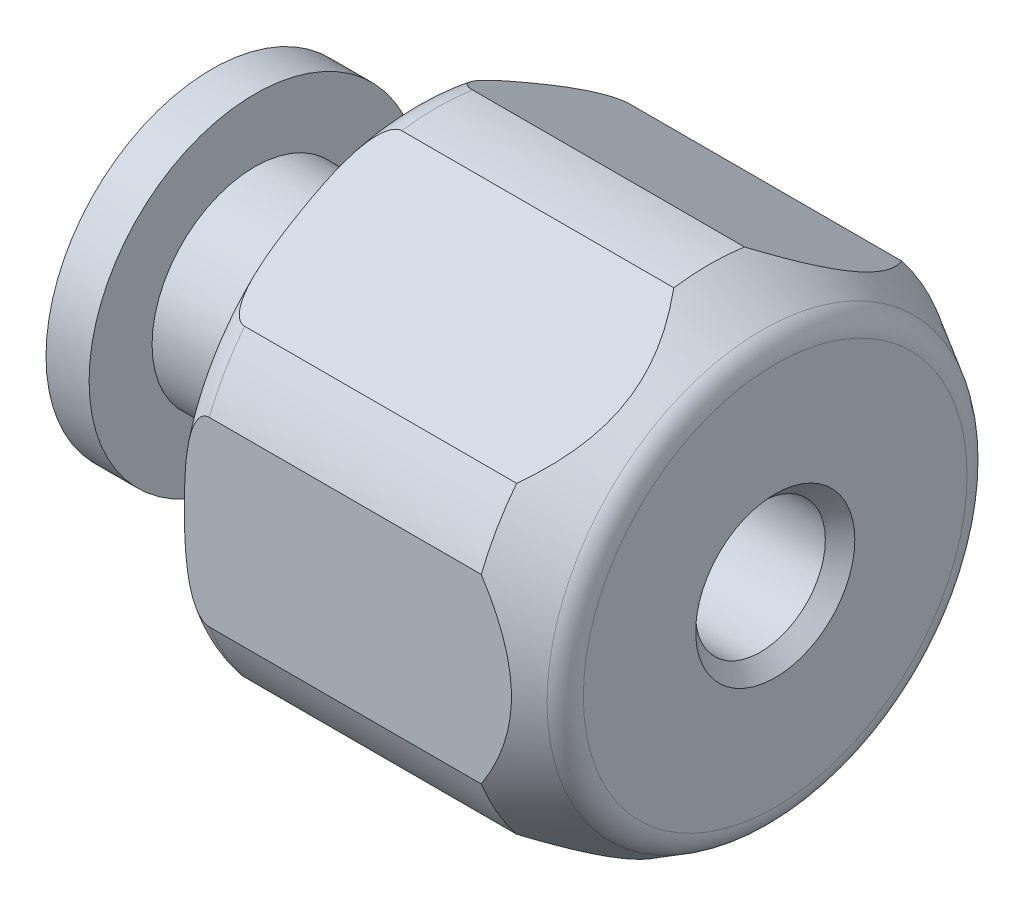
ISO-10303-21;
HEADER;
FILE_DESCRIPTION(('STEP AP214'),'2;1');
FILE_NAME('part.step','',(''),(''),'','','');
FILE_SCHEMA(('AUTOMOTIVE_DESIGN { 1 0 10303 214 1 1 1 1 }'));
ENDSEC;
DATA;
#1=APPLICATION_CONTEXT('core data for automotive mechanical design processes');
#2=APPLICATION_PROTOCOL_DEFINITION('international standard','automotive_design',2000,#1);
#3=PRODUCT_CONTEXT('',#1,'mechanical');
#4=PRODUCT('Part','Part','',(#3));
#5=PRODUCT_RELATED_PRODUCT_CATEGORY('part','',(#4));
#6=PRODUCT_DEFINITION_FORMATION('','',#4);
#7=PRODUCT_DEFINITION_CONTEXT('part definition',#1,'design');
#8=PRODUCT_DEFINITION('design','',#6,#7);
#9=PRODUCT_DEFINITION_SHAPE('','',#8);
#10=(LENGTH_UNIT() NAMED_UNIT(*) SI_UNIT(.MILLI.,.METRE.));
#11=(NAMED_UNIT(*) PLANE_ANGLE_UNIT() SI_UNIT($,.RADIAN.));
#12=(NAMED_UNIT(*) SI_UNIT($,.STERADIAN.) SOLID_ANGLE_UNIT());
#13=UNCERTAINTY_MEASURE_WITH_UNIT(LENGTH_MEASURE(1.E-05),#10,'distance_accuracy_value','');
#14=(GEOMETRIC_REPRESENTATION_CONTEXT(3) GLOBAL_UNCERTAINTY_ASSIGNED_CONTEXT((#13)) GLOBAL_UNIT_ASSIGNED_CONTEXT((#10,
#11,#12)) REPRESENTATION_CONTEXT('',''));
#15=CARTESIAN_POINT('',(0.,0.,0.));
#16=DIRECTION('',(0.,0.,1.));
#17=DIRECTION('',(1.,0.,0.));
#18=AXIS2_PLACEMENT_3D('',#15,#16,#17);
#19=CARTESIAN_POINT('',(0.,0.,0.));
#20=DIRECTION('',(-1.,0.,0.));
#21=DIRECTION('',(0.,0.,1.));
#22=AXIS2_PLACEMENT_3D('',#19,#20,#21);
#23=CYLINDRICAL_SURFACE('',#22,9.398);
#24=CARTESIAN_POINT('',(19.0603397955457,0.,0.));
#25=DIRECTION('',(-1.,0.,0.));
#26=DIRECTION('',(0.,0.,1.));
#27=AXIS2_PLACEMENT_3D('',#24,#25,#26);
#28=CIRCLE('',#27,9.398);
#29=CARTESIAN_POINT('',(19.0603397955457,-3.47673373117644,-8.73124999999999));
#30=VERTEX_POINT('',#29);
#31=CARTESIAN_POINT('',(19.0603397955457,-5.82311744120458,-7.37656473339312));
#32=VERTEX_POINT('',#31);
#33=EDGE_CURVE('E151',#30,#32,#28,.T.);
#34=ORIENTED_EDGE('',*,*,#33,.T.);
#35=DIRECTION('',(-1.,0.,0.));
#36=VECTOR('',#35,1.);
#37=CARTESIAN_POINT('',(0.,-5.82311744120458,-7.37656473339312));
#38=LINE('',#37,#36);
#39=CARTESIAN_POINT('',(8.63600000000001,-5.82311744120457,-7.37656473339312));
#40=VERTEX_POINT('',#39);
#41=EDGE_CURVE('E137',#32,#40,#38,.T.);
#42=ORIENTED_EDGE('',*,*,#41,.T.);
#43=CARTESIAN_POINT('',(8.636,0.,0.));
#44=DIRECTION('',(-1.,0.,0.));
#45=DIRECTION('',(0.,0.,1.));
#46=AXIS2_PLACEMENT_3D('',#43,#44,#45);
#47=CIRCLE('',#46,9.398);
#48=CARTESIAN_POINT('',(8.636,-3.47673373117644,-8.73125));
#49=VERTEX_POINT('',#48);
#50=EDGE_CURVE('E149',#49,#40,#47,.T.);
#51=ORIENTED_EDGE('',*,*,#50,.F.);
#52=DIRECTION('',(-1.,0.,0.));
#53=VECTOR('',#52,1.);
#54=CARTESIAN_POINT('',(0.,-3.47673373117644,-8.73124999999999));
#55=LINE('',#54,#53);
#56=EDGE_CURVE('E778',#49,#30,#55,.F.);
#57=ORIENTED_EDGE('',*,*,#56,.T.);
#58=EDGE_LOOP('',(#34,#42,#51,#57));
#59=FACE_BOUND('',#58,.T.);
#60=ADVANCED_FACE('F16',(#59),#23,.T.);
#61=CARTESIAN_POINT('',(8.636,-9.29985117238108,-1.35468526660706));
#62=VERTEX_POINT('',#61);
#63=CARTESIAN_POINT('',(8.63600000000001,-9.29985117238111,1.35468526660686));
#64=VERTEX_POINT('',#63);
#65=EDGE_CURVE('E161',#62,#64,#47,.T.);
#66=ORIENTED_EDGE('',*,*,#65,.F.);
#67=DIRECTION('',(-1.,0.,0.));
#68=VECTOR('',#67,1.);
#69=CARTESIAN_POINT('',(0.,-9.29985117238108,-1.35468526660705));
#70=LINE('',#69,#68);
#71=CARTESIAN_POINT('',(19.0603397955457,-9.29985117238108,-1.35468526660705));
#72=VERTEX_POINT('',#71);
#73=EDGE_CURVE('E37',#62,#72,#70,.F.);
#74=ORIENTED_EDGE('',*,*,#73,.T.);
#75=CARTESIAN_POINT('',(19.0603397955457,-9.29985117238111,1.35468526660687));
#76=VERTEX_POINT('',#75);
#77=EDGE_CURVE('E608',#72,#76,#28,.T.);
#78=ORIENTED_EDGE('',*,*,#77,.T.);
#79=DIRECTION('',(-1.,0.,0.));
#80=VECTOR('',#79,1.);
#81=CARTESIAN_POINT('',(0.,-9.29985117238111,1.35468526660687));
#82=LINE('',#81,#80);
#83=EDGE_CURVE('E305',#76,#64,#82,.T.);
#84=ORIENTED_EDGE('',*,*,#83,.T.);
#85=EDGE_LOOP('',(#66,#74,#78,#84));
#86=FACE_BOUND('',#85,.T.);
#87=ADVANCED_FACE('F353',(#86),#23,.T.);
#88=CARTESIAN_POINT('',(8.636,-5.82311744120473,7.376564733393));
#89=VERTEX_POINT('',#88);
#90=CARTESIAN_POINT('',(8.6360000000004,-3.47673373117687,8.73124999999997));
#91=VERTEX_POINT('',#90);
#92=EDGE_CURVE('E173',#89,#91,#47,.T.);
#93=ORIENTED_EDGE('',*,*,#92,.F.);
#94=DIRECTION('',(-1.,0.,0.));
#95=VECTOR('',#94,1.);
#96=CARTESIAN_POINT('',(0.,-5.82311744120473,7.37656473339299));
#97=LINE('',#96,#95);
#98=CARTESIAN_POINT('',(19.0603397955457,-5.82311744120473,7.37656473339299));
#99=VERTEX_POINT('',#98);
#100=EDGE_CURVE('E47',#89,#99,#97,.F.);
#101=ORIENTED_EDGE('',*,*,#100,.T.);
#102=CARTESIAN_POINT('',(19.0603397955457,-3.47673373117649,8.73124999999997));
#103=VERTEX_POINT('',#102);
#104=EDGE_CURVE('E611',#99,#103,#28,.T.);
#105=ORIENTED_EDGE('',*,*,#104,.T.);
#106=DIRECTION('',(-1.,0.,0.));
#107=VECTOR('',#106,1.);
#108=CARTESIAN_POINT('',(0.,-3.47673373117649,8.73124999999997));
#109=LINE('',#108,#107);
#110=EDGE_CURVE('E310',#103,#91,#109,.T.);
#111=ORIENTED_EDGE('',*,*,#110,.T.);
#112=EDGE_LOOP('',(#93,#101,#105,#111));
#113=FACE_BOUND('',#112,.T.);
#114=ADVANCED_FACE('F358',(#113),#23,.T.);
#115=CARTESIAN_POINT('',(8.636,3.47673373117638,8.73125000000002));
#116=VERTEX_POINT('',#115);
#117=CARTESIAN_POINT('',(8.63600000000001,5.82311744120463,7.37656473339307));
#118=VERTEX_POINT('',#117);
#119=EDGE_CURVE('E185',#116,#118,#47,.T.);
#120=ORIENTED_EDGE('',*,*,#119,.F.);
#121=DIRECTION('',(-1.,0.,0.));
#122=VECTOR('',#121,1.);
#123=CARTESIAN_POINT('',(0.,3.47673373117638,8.73125000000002));
#124=LINE('',#123,#122);
#125=CARTESIAN_POINT('',(19.0603397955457,3.47673373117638,8.73125000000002));
#126=VERTEX_POINT('',#125);
#127=EDGE_CURVE('E304',#116,#126,#124,.F.);
#128=ORIENTED_EDGE('',*,*,#127,.T.);
#129=CARTESIAN_POINT('',(19.0603397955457,5.82311744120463,7.37656473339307));
#130=VERTEX_POINT('',#129);
#131=EDGE_CURVE('E623',#126,#130,#28,.T.);
#132=ORIENTED_EDGE('',*,*,#131,.T.);
#133=DIRECTION('',(-1.,0.,0.));
#134=VECTOR('',#133,1.);
#135=CARTESIAN_POINT('',(0.,5.82311744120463,7.37656473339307));
#136=LINE('',#135,#134);
#137=EDGE_CURVE('E325',#130,#118,#136,.T.);
#138=ORIENTED_EDGE('',*,*,#137,.T.);
#139=EDGE_LOOP('',(#120,#128,#132,#138));
#140=FACE_BOUND('',#139,.T.);
#141=ADVANCED_FACE('F370',(#140),#23,.T.);
#142=CARTESIAN_POINT('',(8.636,9.29985117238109,1.35468526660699));
#143=VERTEX_POINT('',#142);
#144=CARTESIAN_POINT('',(8.63600000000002,9.29985117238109,-1.35468526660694));
#145=VERTEX_POINT('',#144);
#146=EDGE_CURVE('E176',#143,#145,#47,.T.);
#147=ORIENTED_EDGE('',*,*,#146,.F.);
#148=DIRECTION('',(-1.,0.,0.));
#149=VECTOR('',#148,1.);
#150=CARTESIAN_POINT('',(0.,9.29985117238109,1.35468526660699));
#151=LINE('',#150,#149);
#152=CARTESIAN_POINT('',(19.0603397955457,9.29985117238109,1.35468526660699));
#153=VERTEX_POINT('',#152);
#154=EDGE_CURVE('E321',#143,#153,#151,.F.);
#155=ORIENTED_EDGE('',*,*,#154,.T.);
#156=CARTESIAN_POINT('',(19.0603397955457,9.2998511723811,-1.35468526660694));
#157=VERTEX_POINT('',#156);
#158=EDGE_CURVE('E170',#153,#157,#28,.T.);
#159=ORIENTED_EDGE('',*,*,#158,.T.);
#160=DIRECTION('',(-1.,0.,0.));
#161=VECTOR('',#160,1.);
#162=CARTESIAN_POINT('',(0.,9.2998511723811,-1.35468526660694));
#163=LINE('',#162,#161);
#164=EDGE_CURVE('E383',#157,#145,#163,.T.);
#165=ORIENTED_EDGE('',*,*,#164,.T.);
#166=EDGE_LOOP('',(#147,#155,#159,#165));
#167=FACE_BOUND('',#166,.T.);
#168=ADVANCED_FACE('F362',(#167),#23,.T.);
#169=CARTESIAN_POINT('',(21.59,7.9375,0.));
#170=DIRECTION('',(-1.,0.,0.));
#171=DIRECTION('',(0.,0.,1.));
#172=AXIS2_PLACEMENT_3D('',#169,#170,#171);
#173=PLANE('',#172);
#174=CARTESIAN_POINT('',(21.59,0.,0.));
#175=DIRECTION('',(1.,0.,0.));
#176=DIRECTION('',(0.,0.,-1.));
#177=AXIS2_PLACEMENT_3D('',#174,#175,#176);
#178=CIRCLE('',#177,3.05);
#179=CARTESIAN_POINT('',(21.59,0.,-3.05));
#180=VERTEX_POINT('',#179);
#181=EDGE_CURVE('E660',#180,#180,#178,.T.);
#182=ORIENTED_EDGE('',*,*,#181,.F.);
#183=EDGE_LOOP('',(#182));
#184=FACE_BOUND('',#183,.T.);
#185=CARTESIAN_POINT('',(21.59,0.,0.));
#186=DIRECTION('',(-1.,0.,0.));
#187=DIRECTION('',(0.,0.,1.));
#188=AXIS2_PLACEMENT_3D('',#185,#186,#187);
#189=CIRCLE('',#188,7.35091212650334);
#190=CARTESIAN_POINT('',(21.59,0.,7.35091212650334));
#191=VERTEX_POINT('',#190);
#192=EDGE_CURVE('E10',#191,#191,#189,.F.);
#193=ORIENTED_EDGE('',*,*,#192,.T.);
#194=EDGE_LOOP('',(#193));
#195=FACE_BOUND('',#194,.T.);
#196=ADVANCED_FACE('F367',(#184,#195),#173,.F.);
#197=CARTESIAN_POINT('',(21.59,0.,0.));
#198=DIRECTION('',(-1.,0.,0.));
#199=DIRECTION('',(0.,0.,1.));
#200=AXIS2_PLACEMENT_3D('',#197,#198,#199);
#201=CONICAL_SURFACE('',#200,7.9375,0.5235987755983);
#202=CARTESIAN_POINT('',(21.082,0.,0.));
#203=DIRECTION('',(1.,0.,0.));
#204=DIRECTION('',(0.,0.,-1.));
#205=AXIS2_PLACEMENT_3D('',#202,#203,#204);
#206=CIRCLE('',#205,8.23079393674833);
#207=CARTESIAN_POINT('',(21.082,0.,-8.23079393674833));
#208=VERTEX_POINT('',#207);
#209=EDGE_CURVE('E25',#208,#208,#206,.F.);
#210=ORIENTED_EDGE('',*,*,#209,.T.);
#211=EDGE_LOOP('',(#210));
#212=FACE_BOUND('',#211,.T.);
#213=ORIENTED_EDGE('',*,*,#77,.F.);
#214=CARTESIAN_POINT('',(19.0601397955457,-9.3000072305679,-1.35441496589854));
#215=CARTESIAN_POINT('',(19.1626166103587,-9.22001746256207,-1.49296130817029));
#216=CARTESIAN_POINT('',(19.2608922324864,-9.13860187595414,-1.63397724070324));
#217=CARTESIAN_POINT('',(19.4471795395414,-8.97255627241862,-1.92157666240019));
#218=CARTESIAN_POINT('',(19.5351574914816,-8.88791683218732,-2.06817647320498));
#219=CARTESIAN_POINT('',(19.6992235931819,-8.71460091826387,-2.36836844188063));
#220=CARTESIAN_POINT('',(19.775166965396,-8.62588975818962,-2.5220206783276));
#221=CARTESIAN_POINT('',(19.9111912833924,-8.4455863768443,-2.83431529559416));
#222=CARTESIAN_POINT('',(19.9712959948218,-8.35399870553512,-2.99294979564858));
#223=CARTESIAN_POINT('',(20.0612431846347,-8.18992069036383,-3.2771412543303));
#224=CARTESIAN_POINT('',(20.0948733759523,-8.11794909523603,-3.40179971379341));
#225=CARTESIAN_POINT('',(20.1502454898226,-7.97285500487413,-3.65311005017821));
#226=CARTESIAN_POINT('',(20.1719870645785,-7.89973247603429,-3.77976198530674));
#227=CARTESIAN_POINT('',(20.2027005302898,-7.75328302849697,-4.03341986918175));
#228=CARTESIAN_POINT('',(20.2117524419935,-7.6799603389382,-4.16041849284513));
#229=CARTESIAN_POINT('',(20.2170032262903,-7.53320103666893,-4.41461306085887));
#230=CARTESIAN_POINT('',(20.2132025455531,-7.45976442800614,-4.54180899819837));
#231=CARTESIAN_POINT('',(20.1929022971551,-7.3133954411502,-4.79532752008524));
#232=CARTESIAN_POINT('',(20.1764129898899,-7.24046270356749,-4.92165072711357));
#233=CARTESIAN_POINT('',(20.1313493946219,-7.09554142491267,-5.17266174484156));
#234=CARTESIAN_POINT('',(20.102774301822,-7.02355294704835,-5.2973494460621));
#235=CARTESIAN_POINT('',(20.0342929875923,-6.88052206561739,-5.54508619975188));
#236=CARTESIAN_POINT('',(19.9943245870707,-6.80948715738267,-5.66812226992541));
#237=CARTESIAN_POINT('',(19.9042726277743,-6.66902930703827,-5.91140240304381));
#238=CARTESIAN_POINT('',(19.8541851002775,-6.59960700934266,-6.03164534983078));
#239=CARTESIAN_POINT('',(19.7005009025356,-6.40648017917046,-6.36615083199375));
#240=CARTESIAN_POINT('',(19.5866350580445,-6.28479682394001,-6.57691258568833));
#241=CARTESIAN_POINT('',(19.3996873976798,-6.10752247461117,-6.88396076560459));
#242=CARTESIAN_POINT('',(19.3350747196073,-6.04960737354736,-6.98427266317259));
#243=CARTESIAN_POINT('',(19.2010508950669,-5.9352286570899,-7.18238241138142));
#244=CARTESIAN_POINT('',(19.131642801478,-5.87876414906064,-7.28018180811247));
#245=CARTESIAN_POINT('',(19.0601397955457,-5.82296138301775,-7.37683503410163));
#246=B_SPLINE_CURVE_WITH_KNOTS('',3,(#214,#215,#216,#217,#218,#219,#220,#221,#222,#223,#224,
#225,#226,#227,#228,#229,#230,#231,#232,#233,#234,#235,#236,#237,#238,#239,#240,#241,#242,#243,
#244,#245),.UNSPECIFIED.,.F.,.F.,(4,2,2,2,2,2,2,2,2,2,2,2,2,2,2,4),(0.,0.570096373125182,
1.14201088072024,1.72035458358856,2.29782548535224,2.7408382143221,3.18386390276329,
3.6240831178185,4.06428703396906,4.50413536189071,4.94401298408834,5.38633877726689,
5.82883838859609,6.63309300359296,7.03091274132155,7.42848151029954),.UNSPECIFIED.);
#247=EDGE_CURVE('E153',#72,#32,#246,.T.);
#248=ORIENTED_EDGE('',*,*,#247,.T.);
#249=ORIENTED_EDGE('',*,*,#33,.F.);
#250=CARTESIAN_POINT('',(11.2847195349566,-10.7991279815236,-8.73125));
#251=CARTESIAN_POINT('',(11.5246930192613,-10.6209422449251,-8.73125));
#252=CARTESIAN_POINT('',(11.7638523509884,-10.441651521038,-8.73125));
#253=CARTESIAN_POINT('',(12.240255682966,-10.0805104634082,-8.73125));
#254=CARTESIAN_POINT('',(12.477499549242,-9.89865995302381,-8.73125));
#255=CARTESIAN_POINT('',(12.9502173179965,-9.53171275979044,-8.73125));
#256=CARTESIAN_POINT('',(13.1856868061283,-9.34661038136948,-8.73125));
#257=CARTESIAN_POINT('',(13.6539779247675,-8.97309166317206,-8.73125));
#258=CARTESIAN_POINT('',(13.8867996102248,-8.78467539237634,-8.73125));
#259=CARTESIAN_POINT('',(14.3580482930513,-8.39682674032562,-8.73125));
#260=CARTESIAN_POINT('',(14.5963544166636,-8.19724719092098,-8.73125));
#261=CARTESIAN_POINT('',(15.0688671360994,-7.79329559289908,-8.73125));
#262=CARTESIAN_POINT('',(15.3030738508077,-7.58892368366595,-8.73125));
#263=CARTESIAN_POINT('',(15.766279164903,-7.17470336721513,-8.73125));
#264=CARTESIAN_POINT('',(15.9952817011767,-6.96485937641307,-8.73125));
#265=CARTESIAN_POINT('',(16.446995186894,-6.538526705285,-8.73125));
#266=CARTESIAN_POINT('',(16.669706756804,-6.32203868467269,-8.73125));
#267=CARTESIAN_POINT('',(17.127006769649,-5.86112591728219,-8.73125));
#268=CARTESIAN_POINT('',(17.3608408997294,-5.61594801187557,-8.73125));
#269=CARTESIAN_POINT('',(17.8160525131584,-5.11394195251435,-8.73125));
#270=CARTESIAN_POINT('',(18.0374231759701,-4.85710755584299,-8.73125));
#271=CARTESIAN_POINT('',(18.4608005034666,-4.33210069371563,-8.73125));
#272=CARTESIAN_POINT('',(18.662980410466,-4.06406921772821,-8.73125));
#273=CARTESIAN_POINT('',(19.0436526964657,-3.51182786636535,-8.73125));
#274=CARTESIAN_POINT('',(19.2221768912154,-3.22764047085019,-8.73125));
#275=CARTESIAN_POINT('',(19.4805413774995,-2.75934057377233,-8.73125));
#276=CARTESIAN_POINT('',(19.5711194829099,-2.58116035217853,-8.73125));
#277=CARTESIAN_POINT('',(19.7379461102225,-2.2176967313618,-8.73125));
#278=CARTESIAN_POINT('',(19.8141671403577,-2.03240050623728,-8.73125));
#279=CARTESIAN_POINT('',(19.9326116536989,-1.70145512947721,-8.73125));
#280=CARTESIAN_POINT('',(19.9785934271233,-1.55715137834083,-8.73125));
#281=CARTESIAN_POINT('',(20.0592160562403,-1.26542339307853,-8.73125));
#282=CARTESIAN_POINT('',(20.0938604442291,-1.11800014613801,-8.73125));
#283=CARTESIAN_POINT('',(20.1506410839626,-0.820903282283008,-8.73125));
#284=CARTESIAN_POINT('',(20.1727904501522,-0.671232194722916,-8.73125));
#285=CARTESIAN_POINT('',(20.203806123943,-0.370514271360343,-8.73125));
#286=CARTESIAN_POINT('',(20.212673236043,-0.21946751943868,-8.73125));
#287=CARTESIAN_POINT('',(20.2167768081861,0.0833160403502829,-8.73125));
#288=CARTESIAN_POINT('',(20.2119678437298,0.23505347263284,-8.73125));
#289=CARTESIAN_POINT('',(20.1888180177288,0.537482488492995,-8.73125));
#290=CARTESIAN_POINT('',(20.170476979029,0.688174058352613,-8.73125));
#291=CARTESIAN_POINT('',(20.1209642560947,0.987467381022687,-8.73125));
#292=CARTESIAN_POINT('',(20.0897882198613,1.13606840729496,-8.73125));
#293=CARTESIAN_POINT('',(20.0156917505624,1.43029869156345,-8.73125));
#294=CARTESIAN_POINT('',(19.9727696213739,1.57592751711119,-8.73125));
#295=CARTESIAN_POINT('',(19.8555202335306,1.92619957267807,-8.73125));
#296=CARTESIAN_POINT('',(19.7756507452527,2.12899103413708,-8.73125));
#297=CARTESIAN_POINT('',(19.5982231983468,2.52667110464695,-8.73125));
#298=CARTESIAN_POINT('',(19.50065512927,2.72155516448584,-8.73125));
#299=CARTESIAN_POINT('',(19.290245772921,3.1054619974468,-8.73125));
#300=CARTESIAN_POINT('',(19.1772563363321,3.29440283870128,-8.73125));
#301=CARTESIAN_POINT('',(18.9397822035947,3.66474500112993,-8.73125));
#302=CARTESIAN_POINT('',(18.8153016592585,3.84614901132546,-8.73125));
#303=CARTESIAN_POINT('',(18.4825792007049,4.30511094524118,-8.73125));
#304=CARTESIAN_POINT('',(18.26748502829,4.57768913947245,-8.73125));
#305=CARTESIAN_POINT('',(17.82091815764,5.10918069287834,-8.73125));
#306=CARTESIAN_POINT('',(17.5894340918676,5.3680843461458,-8.73125));
#307=CARTESIAN_POINT('',(17.1136026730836,5.87557198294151,-8.73125));
#308=CARTESIAN_POINT('',(16.8692097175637,6.1241129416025,-8.73125));
#309=CARTESIAN_POINT('',(16.3714309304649,6.61182524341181,-8.73125));
#310=CARTESIAN_POINT('',(16.1180475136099,6.85099906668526,-8.73125));
#311=CARTESIAN_POINT('',(15.621635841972,7.30579411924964,-8.73125));
#312=CARTESIAN_POINT('',(15.3790635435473,7.52191524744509,-8.73125));
#313=CARTESIAN_POINT('',(14.8890239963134,7.94856682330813,-8.73125));
#314=CARTESIAN_POINT('',(14.641556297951,8.1590967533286,-8.73125));
#315=CARTESIAN_POINT('',(14.1448862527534,8.57354591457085,-8.73125));
#316=CARTESIAN_POINT('',(13.8957190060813,8.7775073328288,-8.73125));
#317=CARTESIAN_POINT('',(13.3941986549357,9.18135328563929,-8.73125));
#318=CARTESIAN_POINT('',(13.1418463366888,9.38123879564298,-8.73125));
#319=CARTESIAN_POINT('',(12.888191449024,9.57943294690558,-8.73125));
#320=B_SPLINE_CURVE_WITH_KNOTS('',3,(#250,#251,#252,#253,#254,#255,#256,#257,#258,#259,#260,
#261,#262,#263,#264,#265,#266,#267,#268,#269,#270,#271,#272,#273,#274,#275,#276,#277,#278,#279,
#280,#281,#282,#283,#284,#285,#286,#287,#288,#289,#290,#291,#292,#293,#294,#295,#296,#297,#298,
#299,#300,#301,#302,#303,#304,#305,#306,#307,#308,#309,#310,#311,#312,#313,#314,#315,#316,#317,
#318,#319),.UNSPECIFIED.,.F.,.F.,(4,2,2,2,2,2,2,2,2,2,2,2,2,2,2,2,2,2,2,2,2,2,2,2,2,2,2,2,2,2,2,
2,2,2,4),(0.,0.896685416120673,1.79343301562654,2.69194946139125,3.59044722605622,
4.52291491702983,5.45535552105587,6.38706553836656,7.31868333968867,8.33477962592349,
9.35142666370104,10.357788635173,11.3627830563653,11.9619257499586,12.5622043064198,
13.0161629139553,13.4699799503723,13.9233197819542,14.3766321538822,14.8314519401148,
15.2862776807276,15.7412577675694,16.1963035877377,16.8490683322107,17.5022034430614,
18.1621242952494,18.8218076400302,19.8625118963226,20.9039451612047,21.9493419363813,
22.9944600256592,23.9690128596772,24.9436556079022,25.9096145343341,26.8753395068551),.UNSPECIFIED.);
#321=CARTESIAN_POINT('',(19.0603397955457,3.47673373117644,-8.73124999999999));
#322=VERTEX_POINT('',#321);
#323=EDGE_CURVE('E211',#30,#322,#320,.T.);
#324=ORIENTED_EDGE('',*,*,#323,.T.);
#325=CARTESIAN_POINT('',(19.0603397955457,5.82311744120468,-7.37656473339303));
#326=VERTEX_POINT('',#325);
#327=EDGE_CURVE('E160',#326,#322,#28,.T.);
#328=ORIENTED_EDGE('',*,*,#327,.F.);
#329=CARTESIAN_POINT('',(19.0601397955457,5.82296138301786,-7.37683503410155));
#330=CARTESIAN_POINT('',(19.1626166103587,5.9029511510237,-7.23828869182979));
#331=CARTESIAN_POINT('',(19.2608922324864,5.98436673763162,-7.09727275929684));
#332=CARTESIAN_POINT('',(19.4471795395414,6.15041234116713,-6.80967333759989));
#333=CARTESIAN_POINT('',(19.5351574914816,6.23505178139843,-6.66307352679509));
#334=CARTESIAN_POINT('',(19.6992235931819,6.40836769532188,-6.36288155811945));
#335=CARTESIAN_POINT('',(19.775166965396,6.49707885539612,-6.20922932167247));
#336=CARTESIAN_POINT('',(19.9111912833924,6.67738223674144,-5.89693470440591));
#337=CARTESIAN_POINT('',(19.9712959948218,6.76896990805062,-5.73830020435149));
#338=CARTESIAN_POINT('',(20.0612431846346,6.93304792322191,-5.45410874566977));
#339=CARTESIAN_POINT('',(20.0948733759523,7.0050195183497,-5.32945028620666));
#340=CARTESIAN_POINT('',(20.1502454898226,7.1501136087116,-5.07813994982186));
#341=CARTESIAN_POINT('',(20.1719870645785,7.22323613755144,-4.95148801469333));
#342=CARTESIAN_POINT('',(20.2027005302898,7.36968558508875,-4.69783013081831));
#343=CARTESIAN_POINT('',(20.2117524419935,7.44300827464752,-4.57083150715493));
#344=CARTESIAN_POINT('',(20.2170032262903,7.58976757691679,-4.31663693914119));
#345=CARTESIAN_POINT('',(20.2132025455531,7.66320418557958,-4.18944100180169));
#346=CARTESIAN_POINT('',(20.1929022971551,7.80957317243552,-3.93592247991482));
#347=CARTESIAN_POINT('',(20.1764129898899,7.88250591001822,-3.80959927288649));
#348=CARTESIAN_POINT('',(20.1313493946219,8.02742718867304,-3.5585882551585));
#349=CARTESIAN_POINT('',(20.1027743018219,8.09941566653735,-3.43390055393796));
#350=CARTESIAN_POINT('',(20.0342929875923,8.24244654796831,-3.18616380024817));
#351=CARTESIAN_POINT('',(19.9943245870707,8.31348145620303,-3.06312773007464));
#352=CARTESIAN_POINT('',(19.9042726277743,8.45393930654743,-2.81984759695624));
#353=CARTESIAN_POINT('',(19.8541851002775,8.52336160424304,-2.69960465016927));
#354=CARTESIAN_POINT('',(19.7005009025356,8.71648843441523,-2.3650991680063));
#355=CARTESIAN_POINT('',(19.5866350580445,8.83817178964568,-2.15433741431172));
#356=CARTESIAN_POINT('',(19.3996873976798,9.01544613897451,-1.84728923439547));
#357=CARTESIAN_POINT('',(19.3350747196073,9.07336124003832,-1.74697733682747));
#358=CARTESIAN_POINT('',(19.2010508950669,9.18773995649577,-1.54886758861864));
#359=CARTESIAN_POINT('',(19.131642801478,9.24420446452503,-1.45106819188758));
#360=CARTESIAN_POINT('',(19.0601397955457,9.30000723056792,-1.35441496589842));
#361=B_SPLINE_CURVE_WITH_KNOTS('',3,(#329,#330,#331,#332,#333,#334,#335,#336,#337,#338,#339,
#340,#341,#342,#343,#344,#345,#346,#347,#348,#349,#350,#351,#352,#353,#354,#355,#356,#357,#358,
#359,#360),.UNSPECIFIED.,.F.,.F.,(4,2,2,2,2,2,2,2,2,2,2,2,2,2,2,4),(0.,0.570096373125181,
1.14201088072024,1.72035458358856,2.29782548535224,2.7408382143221,3.18386390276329,
3.6240831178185,4.06428703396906,4.5041353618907,4.94401298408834,5.38633877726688,
5.82883838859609,6.63309300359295,7.03091274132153,7.42848151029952),.UNSPECIFIED.);
#362=EDGE_CURVE('E783',#326,#157,#361,.T.);
#363=ORIENTED_EDGE('',*,*,#362,.T.);
#364=ORIENTED_EDGE('',*,*,#158,.F.);
#365=CARTESIAN_POINT('',(19.0601397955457,9.30000723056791,1.35441496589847));
#366=CARTESIAN_POINT('',(19.1626166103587,9.22001746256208,1.49296130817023));
#367=CARTESIAN_POINT('',(19.2608922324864,9.13860187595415,1.63397724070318));
#368=CARTESIAN_POINT('',(19.4471795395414,8.97255627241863,1.92157666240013));
#369=CARTESIAN_POINT('',(19.5351574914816,8.88791683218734,2.06817647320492));
#370=CARTESIAN_POINT('',(19.6992235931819,8.71460091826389,2.36836844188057));
#371=CARTESIAN_POINT('',(19.775166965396,8.62588975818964,2.52202067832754));
#372=CARTESIAN_POINT('',(19.9111912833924,8.44558637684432,2.8343152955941));
#373=CARTESIAN_POINT('',(19.9712959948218,8.35399870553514,2.99294979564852));
#374=CARTESIAN_POINT('',(20.0612431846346,8.18992069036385,3.27714125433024));
#375=CARTESIAN_POINT('',(20.0948733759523,8.11794909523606,3.40179971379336));
#376=CARTESIAN_POINT('',(20.1502454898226,7.97285500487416,3.65311005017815));
#377=CARTESIAN_POINT('',(20.1719870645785,7.89973247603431,3.77976198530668));
#378=CARTESIAN_POINT('',(20.2027005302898,7.753283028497,4.0334198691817));
#379=CARTESIAN_POINT('',(20.2117524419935,7.67996033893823,4.16041849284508));
#380=CARTESIAN_POINT('',(20.2170032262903,7.53320103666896,4.41461306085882));
#381=CARTESIAN_POINT('',(20.2132025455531,7.45976442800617,4.54180899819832));
#382=CARTESIAN_POINT('',(20.1929022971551,7.31339544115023,4.79532752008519));
#383=CARTESIAN_POINT('',(20.1764129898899,7.24046270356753,4.92165072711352));
#384=CARTESIAN_POINT('',(20.1313493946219,7.09554142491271,5.17266174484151));
#385=CARTESIAN_POINT('',(20.102774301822,7.02355294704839,5.29734944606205));
#386=CARTESIAN_POINT('',(20.0342929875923,6.88052206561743,5.54508619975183));
#387=CARTESIAN_POINT('',(19.9943245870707,6.80948715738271,5.66812226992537));
#388=CARTESIAN_POINT('',(19.9042726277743,6.66902930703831,5.91140240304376));
#389=CARTESIAN_POINT('',(19.8541851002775,6.5996070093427,6.03164534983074));
#390=CARTESIAN_POINT('',(19.7005009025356,6.4064801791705,6.36615083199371));
#391=CARTESIAN_POINT('',(19.5866350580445,6.28479682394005,6.5769125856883));
#392=CARTESIAN_POINT('',(19.3996873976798,6.10752247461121,6.88396076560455));
#393=CARTESIAN_POINT('',(19.3350747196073,6.0496073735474,6.98427266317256));
#394=CARTESIAN_POINT('',(19.2010508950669,5.93522865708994,7.18238241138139));
#395=CARTESIAN_POINT('',(19.131642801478,5.87876414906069,7.28018180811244));
#396=CARTESIAN_POINT('',(19.0601397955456,5.82296138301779,7.37683503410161));
#397=B_SPLINE_CURVE_WITH_KNOTS('',3,(#365,#366,#367,#368,#369,#370,#371,#372,#373,#374,#375,
#376,#377,#378,#379,#380,#381,#382,#383,#384,#385,#386,#387,#388,#389,#390,#391,#392,#393,#394,
#395,#396),.UNSPECIFIED.,.F.,.F.,(4,2,2,2,2,2,2,2,2,2,2,2,2,2,2,4),(0.,0.57009637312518,
1.14201088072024,1.72035458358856,2.29782548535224,2.7408382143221,3.18386390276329,
3.6240831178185,4.06428703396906,4.5041353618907,4.94401298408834,5.38633877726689,
5.82883838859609,6.63309300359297,7.03091274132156,7.42848151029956),.UNSPECIFIED.);
#398=EDGE_CURVE('E329',#153,#130,#397,.T.);
#399=ORIENTED_EDGE('',*,*,#398,.T.);
#400=ORIENTED_EDGE('',*,*,#131,.F.);
#401=CARTESIAN_POINT('',(10.8455680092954,-11.1232871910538,8.73124999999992));
#402=CARTESIAN_POINT('',(11.0994601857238,-10.936918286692,8.73124999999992));
#403=CARTESIAN_POINT('',(11.3525221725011,-10.749409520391,8.73124999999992));
#404=CARTESIAN_POINT('',(11.8566853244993,-10.3717392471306,8.73124999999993));
#405=CARTESIAN_POINT('',(12.1077863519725,-10.1815775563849,8.73124999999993));
#406=CARTESIAN_POINT('',(12.6082077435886,-9.79785857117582,8.73124999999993));
#407=CARTESIAN_POINT('',(12.8575233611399,-9.60429507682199,8.73124999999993));
#408=CARTESIAN_POINT('',(13.353423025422,-9.2137063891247,8.73124999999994));
#409=CARTESIAN_POINT('',(13.6000071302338,-9.01668126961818,8.73124999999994));
#410=CARTESIAN_POINT('',(14.0999156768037,-8.6105036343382,8.73124999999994));
#411=CARTESIAN_POINT('',(14.3531048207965,-8.40118424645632,8.73124999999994));
#412=CARTESIAN_POINT('',(14.8551857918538,-7.97745660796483,8.73124999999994));
#413=CARTESIAN_POINT('',(15.1040777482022,-7.76304851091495,8.73124999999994));
#414=CARTESIAN_POINT('',(15.5963511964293,-7.32838474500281,8.73124999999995));
#415=CARTESIAN_POINT('',(15.8397370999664,-7.10813408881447,8.73124999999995));
#416=CARTESIAN_POINT('',(16.3198127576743,-6.66047548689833,8.73124999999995));
#417=CARTESIAN_POINT('',(16.5565032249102,-6.43306830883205,8.73124999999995));
#418=CARTESIAN_POINT('',(17.0369522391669,-5.95404372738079,8.73124999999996));
#419=CARTESIAN_POINT('',(17.2801164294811,-5.70182645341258,8.73124999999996));
#420=CARTESIAN_POINT('',(17.7535551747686,-5.18517969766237,8.73124999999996));
#421=CARTESIAN_POINT('',(17.9838219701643,-4.92074303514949,8.73124999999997));
#422=CARTESIAN_POINT('',(18.4239802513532,-4.38003986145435,8.73124999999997));
#423=CARTESIAN_POINT('',(18.6340652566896,-4.10393232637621,8.73124999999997));
#424=CARTESIAN_POINT('',(19.0292737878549,-3.53455152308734,8.73124999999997));
#425=CARTESIAN_POINT('',(19.2144339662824,-3.24130439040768,8.73124999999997));
#426=CARTESIAN_POINT('',(19.4693772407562,-2.77976572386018,8.73124999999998));
#427=CARTESIAN_POINT('',(19.5520648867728,-2.61859514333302,8.73124999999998));
#428=CARTESIAN_POINT('',(19.7059267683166,-2.2903692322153,8.73124999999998));
#429=CARTESIAN_POINT('',(19.7770766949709,-2.12330235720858,8.73124999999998));
#430=CARTESIAN_POINT('',(19.8950791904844,-1.81127913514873,8.73124999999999));
#431=CARTESIAN_POINT('',(19.9439999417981,-1.6671072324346,8.73124999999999));
#432=CARTESIAN_POINT('',(20.0307035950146,-1.3754635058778,8.73124999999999));
#433=CARTESIAN_POINT('',(20.0684896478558,-1.22799262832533,8.73124999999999));
#434=CARTESIAN_POINT('',(20.131683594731,-0.930555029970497,8.73124999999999));
#435=CARTESIAN_POINT('',(20.1571040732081,-0.780591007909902,8.73124999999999));
#436=CARTESIAN_POINT('',(20.1946834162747,-0.479003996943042,8.73124999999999));
#437=CARTESIAN_POINT('',(20.2068432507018,-0.327381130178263,8.73124999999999));
#438=CARTESIAN_POINT('',(20.2174390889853,-0.0229770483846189,8.73125));
#439=CARTESIAN_POINT('',(20.2158139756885,0.129806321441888,8.73125));
#440=CARTESIAN_POINT('',(20.1987616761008,0.434592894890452,8.73125));
#441=CARTESIAN_POINT('',(20.1833343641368,0.586596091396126,8.73125));
#442=CARTESIAN_POINT('',(20.1392886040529,0.888688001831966,8.73125));
#443=CARTESIAN_POINT('',(20.1106678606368,1.03877637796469,8.73125));
#444=CARTESIAN_POINT('',(20.0412733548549,1.3361033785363,8.73125));
#445=CARTESIAN_POINT('',(20.0004978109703,1.48334158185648,8.73125000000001));
#446=CARTESIAN_POINT('',(19.8901384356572,1.83076871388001,8.73125000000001));
#447=CARTESIAN_POINT('',(19.8155144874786,2.02935874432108,8.73125000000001));
#448=CARTESIAN_POINT('',(19.648888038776,2.41909550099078,8.73125000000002));
#449=CARTESIAN_POINT('',(19.5568764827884,2.61023828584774,8.73125000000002));
#450=CARTESIAN_POINT('',(19.3577692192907,2.98697510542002,8.73125000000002));
#451=CARTESIAN_POINT('',(19.2505267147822,3.1724908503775,8.73125000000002));
#452=CARTESIAN_POINT('',(19.0245755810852,3.53624275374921,8.73125000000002));
#453=CARTESIAN_POINT('',(18.9058708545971,3.71448136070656,8.73125000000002));
#454=CARTESIAN_POINT('',(18.5938595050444,4.15720427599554,8.73125000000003));
#455=CARTESIAN_POINT('',(18.3943654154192,4.41731678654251,8.73125000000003));
#456=CARTESIAN_POINT('',(17.9797029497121,4.92482477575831,8.73125000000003));
#457=CARTESIAN_POINT('',(17.7645240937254,5.17221155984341,8.73125000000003));
#458=CARTESIAN_POINT('',(17.3217640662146,5.65726507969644,8.73125000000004));
#459=CARTESIAN_POINT('',(17.0941393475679,5.89489181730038,8.73125000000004));
#460=CARTESIAN_POINT('',(16.6301083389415,6.36123504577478,8.73125000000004));
#461=CARTESIAN_POINT('',(16.3937042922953,6.58995378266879,8.73125000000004));
#462=CARTESIAN_POINT('',(15.9296255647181,7.02541149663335,8.73125000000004));
#463=CARTESIAN_POINT('',(15.7023826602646,7.23261268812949,8.73125000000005));
#464=CARTESIAN_POINT('',(15.2430447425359,7.64159362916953,8.73125000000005));
#465=CARTESIAN_POINT('',(15.0109492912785,7.84337288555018,8.73125000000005));
#466=CARTESIAN_POINT('',(14.5448941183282,8.24052977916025,8.73125000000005));
#467=CARTESIAN_POINT('',(14.3109691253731,8.43594829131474,8.73125000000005));
#468=CARTESIAN_POINT('',(13.8399382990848,8.82279687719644,8.73125000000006));
#469=CARTESIAN_POINT('',(13.6028332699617,9.01422792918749,8.73125000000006));
#470=CARTESIAN_POINT('',(13.3644236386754,9.20399577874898,8.73125000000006));
#471=B_SPLINE_CURVE_WITH_KNOTS('',3,(#401,#402,#403,#404,#405,#406,#407,#408,#409,#410,#411,
#412,#413,#414,#415,#416,#417,#418,#419,#420,#421,#422,#423,#424,#425,#426,#427,#428,#429,#430,
#431,#432,#433,#434,#435,#436,#437,#438,#439,#440,#441,#442,#443,#444,#445,#446,#447,#448,#449,
#450,#451,#452,#453,#454,#455,#456,#457,#458,#459,#460,#461,#462,#463,#464,#465,#466,#467,#468,
#469,#470),.UNSPECIFIED.,.F.,.F.,(4,2,2,2,2,2,2,2,2,2,2,2,2,2,2,2,2,2,2,2,2,2,2,2,2,2,2,2,2,2,2,
2,2,2,4),(0.,0.944859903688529,1.88978559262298,2.83666214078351,3.78351851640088,
4.76899458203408,5.75444094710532,6.73906756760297,7.72358892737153,8.77428903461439,
9.82561463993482,10.8655637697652,11.9039665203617,12.4470340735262,12.9912313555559,
13.4475781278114,13.9037956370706,14.359547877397,14.8152667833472,15.2730072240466,
15.7307518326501,16.1885761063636,16.6464675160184,17.2818559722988,17.9175762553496,
18.5599019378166,19.2020096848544,20.184527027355,21.1677069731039,22.1545797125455,
23.1412019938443,24.0636768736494,24.9862353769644,25.9006212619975,26.8147801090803),.UNSPECIFIED.);
#472=EDGE_CURVE('E314',#126,#103,#471,.F.);
#473=ORIENTED_EDGE('',*,*,#472,.T.);
#474=ORIENTED_EDGE('',*,*,#104,.F.);
#475=CARTESIAN_POINT('',(19.0601397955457,-5.8229613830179,7.37683503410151));
#476=CARTESIAN_POINT('',(19.1626166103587,-5.90295115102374,7.23828869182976));
#477=CARTESIAN_POINT('',(19.2608922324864,-5.98436673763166,7.0972727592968));
#478=CARTESIAN_POINT('',(19.4471795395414,-6.15041234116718,6.80967333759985));
#479=CARTESIAN_POINT('',(19.5351574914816,-6.23505178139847,6.66307352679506));
#480=CARTESIAN_POINT('',(19.6992235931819,-6.40836769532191,6.36288155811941));
#481=CARTESIAN_POINT('',(19.775166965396,-6.49707885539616,6.20922932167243));
#482=CARTESIAN_POINT('',(19.9111912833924,-6.67738223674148,5.89693470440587));
#483=CARTESIAN_POINT('',(19.9712959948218,-6.76896990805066,5.73830020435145));
#484=CARTESIAN_POINT('',(20.0612431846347,-6.93304792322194,5.45410874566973));
#485=CARTESIAN_POINT('',(20.0948733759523,-7.00501951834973,5.32945028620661));
#486=CARTESIAN_POINT('',(20.1502454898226,-7.15011360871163,5.07813994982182));
#487=CARTESIAN_POINT('',(20.1719870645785,-7.22323613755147,4.95148801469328));
#488=CARTESIAN_POINT('',(20.2027005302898,-7.36968558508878,4.69783013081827));
#489=CARTESIAN_POINT('',(20.2117524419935,-7.44300827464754,4.57083150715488));
#490=CARTESIAN_POINT('',(20.2170032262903,-7.58976757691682,4.31663693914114));
#491=CARTESIAN_POINT('',(20.2132025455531,-7.6632041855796,4.18944100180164));
#492=CARTESIAN_POINT('',(20.1929022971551,-7.80957317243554,3.93592247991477));
#493=CARTESIAN_POINT('',(20.1764129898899,-7.88250591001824,3.80959927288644));
#494=CARTESIAN_POINT('',(20.1313493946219,-8.02742718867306,3.55858825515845));
#495=CARTESIAN_POINT('',(20.102774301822,-8.09941566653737,3.4339005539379));
#496=CARTESIAN_POINT('',(20.0342929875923,-8.24244654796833,3.18616380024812));
#497=CARTESIAN_POINT('',(19.9943245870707,-8.31348145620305,3.06312773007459));
#498=CARTESIAN_POINT('',(19.9042726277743,-8.45393930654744,2.81984759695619));
#499=CARTESIAN_POINT('',(19.8541851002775,-8.52336160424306,2.69960465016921));
#500=CARTESIAN_POINT('',(19.7005009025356,-8.71648843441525,2.36509916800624));
#501=CARTESIAN_POINT('',(19.5866350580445,-8.83817178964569,2.15433741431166));
#502=CARTESIAN_POINT('',(19.3996873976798,-9.01544613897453,1.8472892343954));
#503=CARTESIAN_POINT('',(19.3350747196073,-9.07336124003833,1.7469773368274));
#504=CARTESIAN_POINT('',(19.2010508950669,-9.18773995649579,1.54886758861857));
#505=CARTESIAN_POINT('',(19.131642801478,-9.24420446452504,1.45106819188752));
#506=CARTESIAN_POINT('',(19.0601397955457,-9.30000723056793,1.35441496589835));
#507=B_SPLINE_CURVE_WITH_KNOTS('',3,(#475,#476,#477,#478,#479,#480,#481,#482,#483,#484,#485,
#486,#487,#488,#489,#490,#491,#492,#493,#494,#495,#496,#497,#498,#499,#500,#501,#502,#503,#504,
#505,#506),.UNSPECIFIED.,.F.,.F.,(4,2,2,2,2,2,2,2,2,2,2,2,2,2,2,4),(0.,0.570096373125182,
1.14201088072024,1.72035458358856,2.29782548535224,2.7408382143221,3.18386390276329,
3.6240831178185,4.06428703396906,4.50413536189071,4.94401298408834,5.38633877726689,
5.82883838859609,6.63309300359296,7.03091274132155,7.42848151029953),.UNSPECIFIED.);
#508=EDGE_CURVE('E295',#99,#76,#507,.T.);
#509=ORIENTED_EDGE('',*,*,#508,.T.);
#510=EDGE_LOOP('',(#213,#248,#249,#324,#328,#363,#364,#399,#400,#473,#474,#509));
#511=FACE_BOUND('',#510,.T.);
#512=ADVANCED_FACE('F223',(#212,#511),#201,.T.);
#513=CARTESIAN_POINT('',(8.636,5.82311744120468,-7.37656473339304));
#514=VERTEX_POINT('',#513);
#515=CARTESIAN_POINT('',(8.6360000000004,3.47673373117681,-8.73125));
#516=VERTEX_POINT('',#515);
#517=EDGE_CURVE('E163',#514,#516,#47,.T.);
#518=ORIENTED_EDGE('',*,*,#517,.F.);
#519=DIRECTION('',(-1.,0.,0.));
#520=VECTOR('',#519,1.);
#521=CARTESIAN_POINT('',(0.,5.82311744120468,-7.37656473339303));
#522=LINE('',#521,#520);
#523=EDGE_CURVE('E337',#514,#326,#522,.F.);
#524=ORIENTED_EDGE('',*,*,#523,.T.);
#525=ORIENTED_EDGE('',*,*,#327,.T.);
#526=DIRECTION('',(-1.,0.,0.));
#527=VECTOR('',#526,1.);
#528=CARTESIAN_POINT('',(0.,3.47673373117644,-8.73124999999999));
#529=LINE('',#528,#527);
#530=EDGE_CURVE('E221',#322,#516,#529,.T.);
#531=ORIENTED_EDGE('',*,*,#530,.T.);
#532=EDGE_LOOP('',(#518,#524,#525,#531));
#533=FACE_BOUND('',#532,.T.);
#534=ADVANCED_FACE('F255',(#533),#23,.T.);
#535=CARTESIAN_POINT('',(8.636,0.,0.));
#536=DIRECTION('',(-1.,0.,0.));
#537=DIRECTION('',(0.,0.,1.));
#538=AXIS2_PLACEMENT_3D('',#535,#536,#537);
#539=TOROIDAL_SURFACE('',#538,8.382,1.016);
#540=CARTESIAN_POINT('',(7.62,0.,0.));
#541=DIRECTION('',(-1.,0.,0.));
#542=DIRECTION('',(0.,0.,1.));
#543=AXIS2_PLACEMENT_3D('',#540,#541,#542);
#544=CIRCLE('',#543,8.382);
#545=CARTESIAN_POINT('',(7.62,0.,8.382));
#546=VERTEX_POINT('',#545);
#547=EDGE_CURVE('E177',#546,#546,#544,.T.);
#548=ORIENTED_EDGE('',*,*,#547,.F.);
#549=EDGE_LOOP('',(#548));
#550=FACE_BOUND('',#549,.T.);
#551=ORIENTED_EDGE('',*,*,#50,.T.);
#552=CARTESIAN_POINT('',(8.6362,-5.82311746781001,-7.37656468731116));
#553=CARTESIAN_POINT('',(8.61274501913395,-5.82307959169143,-7.37663029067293));
#554=CARTESIAN_POINT('',(8.58937134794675,-5.82420107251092,-7.37468782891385));
#555=CARTESIAN_POINT('',(8.5436513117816,-5.82846980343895,-7.36729417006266));
#556=CARTESIAN_POINT('',(8.52129603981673,-5.83159282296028,-7.36188494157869));
#557=CARTESIAN_POINT('',(8.47304169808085,-5.84047669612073,-7.3464976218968));
#558=CARTESIAN_POINT('',(8.44746735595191,-5.84667111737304,-7.33576856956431));
#559=CARTESIAN_POINT('',(8.39857742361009,-5.86105246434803,-7.31085934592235));
#560=CARTESIAN_POINT('',(8.37527350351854,-5.86924899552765,-7.29666253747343));
#561=CARTESIAN_POINT('',(8.31805023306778,-5.8922963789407,-7.2567432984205));
#562=CARTESIAN_POINT('',(8.28590079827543,-5.90823411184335,-7.22913833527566));
#563=CARTESIAN_POINT('',(8.22663089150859,-5.94225574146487,-7.1702111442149));
#564=CARTESIAN_POINT('',(8.19951987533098,-5.96034357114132,-7.13888210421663));
#565=CARTESIAN_POINT('',(8.14924217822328,-5.99796581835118,-7.07371846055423));
#566=CARTESIAN_POINT('',(8.12609829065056,-6.0175077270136,-7.03987088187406));
#567=CARTESIAN_POINT('',(8.08314155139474,-6.05749672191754,-6.97060791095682));
#568=CARTESIAN_POINT('',(8.06333226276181,-6.07794474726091,-6.93519089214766));
#569=CARTESIAN_POINT('',(8.02641921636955,-6.11949980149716,-6.86321542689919));
#570=CARTESIAN_POINT('',(8.00932270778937,-6.14060842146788,-6.82665422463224));
#571=CARTESIAN_POINT('',(7.97745055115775,-6.18323929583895,-6.75281538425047));
#572=CARTESIAN_POINT('',(7.96267351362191,-6.20476129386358,-6.71553819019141));
#573=CARTESIAN_POINT('',(7.91914484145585,-6.27307226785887,-6.59722011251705));
#574=CARTESIAN_POINT('',(7.89389531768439,-6.32041876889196,-6.51521356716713));
#575=CARTESIAN_POINT('',(7.84980306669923,-6.41586428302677,-6.34989708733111));
#576=CARTESIAN_POINT('',(7.83096698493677,-6.46396402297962,-6.26658589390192));
#577=CARTESIAN_POINT('',(7.79805697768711,-6.56071684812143,-6.09900508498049));
#578=CARTESIAN_POINT('',(7.7839981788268,-6.60937119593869,-6.01473328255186));
#579=CARTESIAN_POINT('',(7.75956501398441,-6.70691222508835,-5.84578726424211));
#580=CARTESIAN_POINT('',(7.74919132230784,-6.75579894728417,-5.76111297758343));
#581=CARTESIAN_POINT('',(7.7312429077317,-6.85397117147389,-5.59107369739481));
#582=CARTESIAN_POINT('',(7.72368404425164,-6.9032573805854,-5.50570747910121));
#583=CARTESIAN_POINT('',(7.71081687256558,-7.00190537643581,-5.33484413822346));
#584=CARTESIAN_POINT('',(7.70550876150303,-7.05126716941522,-5.24934700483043));
#585=CARTESIAN_POINT('',(7.69669480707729,-7.14994089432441,-5.07843909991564));
#586=CARTESIAN_POINT('',(7.69318573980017,-7.19925275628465,-4.99302844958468));
#587=CARTESIAN_POINT('',(7.68764234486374,-7.29789689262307,-4.82217179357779));
#588=CARTESIAN_POINT('',(7.68560802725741,-7.34722916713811,-4.73672578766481));
#589=CARTESIAN_POINT('',(7.68273856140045,-7.44897867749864,-4.56049046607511));
#590=CARTESIAN_POINT('',(7.68198608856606,-7.50139648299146,-4.4697001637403));
#591=CARTESIAN_POINT('',(7.68185141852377,-7.60623217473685,-4.28811941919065));
#592=CARTESIAN_POINT('',(7.6824692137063,-7.65865006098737,-4.19732897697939));
#593=CARTESIAN_POINT('',(7.6851369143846,-7.76332869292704,-4.01602026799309));
#594=CARTESIAN_POINT('',(7.68718276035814,-7.81558946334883,-3.92550195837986));
#595=CARTESIAN_POINT('',(7.69291706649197,-7.92008395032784,-3.74451219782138));
#596=CARTESIAN_POINT('',(7.69660537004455,-7.97231766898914,-3.65404074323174));
#597=CARTESIAN_POINT('',(7.7077186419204,-8.09602649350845,-3.43977077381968));
#598=CARTESIAN_POINT('',(7.71602057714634,-8.16748297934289,-3.31600450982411));
#599=CARTESIAN_POINT('',(7.73785849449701,-8.31021229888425,-3.06879007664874));
#600=CARTESIAN_POINT('',(7.75139448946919,-8.38148513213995,-2.94534190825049));
#601=CARTESIAN_POINT('',(7.78078438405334,-8.50185684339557,-2.73685198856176));
#602=CARTESIAN_POINT('',(7.79466503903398,-8.55107430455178,-2.65160484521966));
#603=CARTESIAN_POINT('',(7.82730105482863,-8.64920091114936,-2.48164457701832));
#604=CARTESIAN_POINT('',(7.84606398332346,-8.69810945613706,-2.39693249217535));
#605=CARTESIAN_POINT('',(7.88042969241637,-8.77379585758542,-2.26583979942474));
#606=CARTESIAN_POINT('',(7.89378159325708,-8.80082866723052,-2.2190175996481));
#607=CARTESIAN_POINT('',(7.92295007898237,-8.85455740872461,-2.12595668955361));
#608=CARTESIAN_POINT('',(7.93876604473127,-8.8812534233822,-2.07971783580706));
#609=CARTESIAN_POINT('',(7.97333947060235,-8.93408690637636,-1.98820755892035));
#610=CARTESIAN_POINT('',(7.99208849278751,-8.96022573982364,-1.94293377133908));
#611=CARTESIAN_POINT('',(8.03324286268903,-9.01176489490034,-1.85366533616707));
#612=CARTESIAN_POINT('',(8.05564510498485,-9.03716582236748,-1.80966963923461));
#613=CARTESIAN_POINT('',(8.09891443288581,-9.08064179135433,-1.73436705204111));
#614=CARTESIAN_POINT('',(8.11877385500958,-9.09896556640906,-1.70262934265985));
#615=CARTESIAN_POINT('',(8.16168749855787,-9.13470986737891,-1.64071839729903));
#616=CARTESIAN_POINT('',(8.18474665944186,-9.15212893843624,-1.61054768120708));
#617=CARTESIAN_POINT('',(8.23495799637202,-9.18571797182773,-1.55236976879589));
#618=CARTESIAN_POINT('',(8.26214820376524,-9.20187396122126,-1.52438677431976));
#619=CARTESIAN_POINT('',(8.32124872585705,-9.23188516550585,-1.47240584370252));
#620=CARTESIAN_POINT('',(8.35314498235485,-9.24574698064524,-1.44839647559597));
#621=CARTESIAN_POINT('',(8.40792735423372,-9.26480988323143,-1.41537855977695));
#622=CARTESIAN_POINT('',(8.42911138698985,-9.27122622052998,-1.40426513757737));
#623=CARTESIAN_POINT('',(8.47314957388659,-9.28236469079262,-1.38497274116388));
#624=CARTESIAN_POINT('',(8.49599789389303,-9.28709242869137,-1.37678405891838));
#625=CARTESIAN_POINT('',(8.53829131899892,-9.29371662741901,-1.36531061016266));
#626=CARTESIAN_POINT('',(8.55749781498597,-9.29599109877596,-1.36137111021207));
#627=CARTESIAN_POINT('',(8.59652086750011,-9.29907550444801,-1.35602876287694));
#628=CARTESIAN_POINT('',(8.61634096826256,-9.29987409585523,-1.35464556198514));
#629=CARTESIAN_POINT('',(8.6362,-9.29985114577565,-1.35468531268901));
#630=B_SPLINE_CURVE_WITH_KNOTS('',3,(#552,#553,#554,#555,#556,#557,#558,#559,#560,#561,#562,
#563,#564,#565,#566,#567,#568,#569,#570,#571,#572,#573,#574,#575,#576,#577,#578,#579,#580,#581,
#582,#583,#584,#585,#586,#587,#588,#589,#590,#591,#592,#593,#594,#595,#596,#597,#598,#599,#600,
#601,#602,#603,#604,#605,#606,#607,#608,#609,#610,#611,#612,#613,#614,#615,#616,#617,#618,#619,
#620,#621,#622,#623,#624,#625,#626,#627,#628,#629),.UNSPECIFIED.,.F.,.F.,(4,2,2,2,2,2,2,2,2,2,2,
2,2,2,2,2,2,2,2,2,2,2,2,2,2,2,2,2,2,2,2,2,2,2,2,2,2,2,4),(0.,0.0701236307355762,
0.139413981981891,0.224191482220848,0.309383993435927,0.444438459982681,0.579743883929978,
0.715802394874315,0.852005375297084,0.98856640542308,1.12504531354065,1.41868113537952,
1.71262029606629,2.00748168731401,2.30239700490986,2.59894966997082,2.8955283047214,
3.19157359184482,3.48762089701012,3.80212649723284,4.11663035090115,4.43024378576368,
4.74382732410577,5.1732286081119,5.6026309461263,5.90077760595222,6.1993891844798,
6.36641409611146,6.53339710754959,6.69990828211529,6.8662786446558,6.99120625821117,
7.11632891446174,7.24268239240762,7.36866578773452,7.44274356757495,7.51657312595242,
7.57556855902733,7.63501554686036),.UNSPECIFIED.);
#631=EDGE_CURVE('E134',#40,#62,#630,.T.);
#632=ORIENTED_EDGE('',*,*,#631,.T.);
#633=ORIENTED_EDGE('',*,*,#65,.T.);
#634=CARTESIAN_POINT('',(8.6362,-9.29985114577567,1.35468531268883));
#635=CARTESIAN_POINT('',(8.61274501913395,-9.29988902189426,1.35461970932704));
#636=CARTESIAN_POINT('',(8.58937134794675,-9.29876754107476,1.35656217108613));
#637=CARTESIAN_POINT('',(8.5436513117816,-9.29449881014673,1.36395582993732));
#638=CARTESIAN_POINT('',(8.52129603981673,-9.2913757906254,1.36936505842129));
#639=CARTESIAN_POINT('',(8.47304169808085,-9.28249191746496,1.38475237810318));
#640=CARTESIAN_POINT('',(8.4474673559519,-9.27629749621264,1.39548143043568));
#641=CARTESIAN_POINT('',(8.39857742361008,-9.26191614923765,1.42039065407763));
#642=CARTESIAN_POINT('',(8.37527350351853,-9.25371961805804,1.43458746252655));
#643=CARTESIAN_POINT('',(8.31805023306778,-9.23067223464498,1.47450670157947));
#644=CARTESIAN_POINT('',(8.28590079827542,-9.21473450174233,1.50211166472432));
#645=CARTESIAN_POINT('',(8.22663089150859,-9.18071287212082,1.56103885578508));
#646=CARTESIAN_POINT('',(8.19951987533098,-9.16262504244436,1.59236789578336));
#647=CARTESIAN_POINT('',(8.14924217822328,-9.1250027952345,1.65753153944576));
#648=CARTESIAN_POINT('',(8.12609829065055,-9.10546088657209,1.69137911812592));
#649=CARTESIAN_POINT('',(8.08314155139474,-9.06547189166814,1.76064208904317));
#650=CARTESIAN_POINT('',(8.06333226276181,-9.04502386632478,1.79605910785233));
#651=CARTESIAN_POINT('',(8.02641921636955,-9.00346881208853,1.86803457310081));
#652=CARTESIAN_POINT('',(8.00932270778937,-8.98236019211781,1.90459577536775));
#653=CARTESIAN_POINT('',(7.97745055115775,-8.93972931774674,1.97843461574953));
#654=CARTESIAN_POINT('',(7.9626735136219,-8.91820731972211,2.01571180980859));
#655=CARTESIAN_POINT('',(7.91914484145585,-8.84989634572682,2.13402988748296));
#656=CARTESIAN_POINT('',(7.89389531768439,-8.80254984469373,2.21603643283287));
#657=CARTESIAN_POINT('',(7.84980306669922,-8.70710433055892,2.3813529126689));
#658=CARTESIAN_POINT('',(7.83096698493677,-8.65900459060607,2.46466410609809));
#659=CARTESIAN_POINT('',(7.79805697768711,-8.56225176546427,2.63224491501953));
#660=CARTESIAN_POINT('',(7.7839981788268,-8.51359741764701,2.71651671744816));
#661=CARTESIAN_POINT('',(7.75956501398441,-8.41605638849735,2.88546273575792));
#662=CARTESIAN_POINT('',(7.74919132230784,-8.36716966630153,2.97013702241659));
#663=CARTESIAN_POINT('',(7.7312429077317,-8.26899744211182,3.14017630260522));
#664=CARTESIAN_POINT('',(7.72368404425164,-8.2197112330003,3.22554252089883));
#665=CARTESIAN_POINT('',(7.71081687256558,-8.12106323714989,3.39640586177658));
#666=CARTESIAN_POINT('',(7.70550876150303,-8.07170144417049,3.48190299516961));
#667=CARTESIAN_POINT('',(7.69669480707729,-7.97302771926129,3.65281090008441));
#668=CARTESIAN_POINT('',(7.69318573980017,-7.92371585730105,3.73822155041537));
#669=CARTESIAN_POINT('',(7.68764234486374,-7.82507172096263,3.90907820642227));
#670=CARTESIAN_POINT('',(7.68560802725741,-7.7757394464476,3.99452421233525));
#671=CARTESIAN_POINT('',(7.68273856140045,-7.67398993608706,4.17075953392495));
#672=CARTESIAN_POINT('',(7.68198608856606,-7.62157213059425,4.26154983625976));
#673=CARTESIAN_POINT('',(7.68185141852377,-7.51673643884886,4.44313058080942));
#674=CARTESIAN_POINT('',(7.6824692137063,-7.46431855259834,4.53392102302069));
#675=CARTESIAN_POINT('',(7.6851369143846,-7.35963992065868,4.71522973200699));
#676=CARTESIAN_POINT('',(7.68718276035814,-7.30737915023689,4.80574804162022));
#677=CARTESIAN_POINT('',(7.69291706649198,-7.20288466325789,4.9867378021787));
#678=CARTESIAN_POINT('',(7.69660537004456,-7.15065094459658,5.07720925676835));
#679=CARTESIAN_POINT('',(7.70771864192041,-7.02694212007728,5.29147922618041));
#680=CARTESIAN_POINT('',(7.71602057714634,-6.95548563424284,5.41524549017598));
#681=CARTESIAN_POINT('',(7.73785849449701,-6.81275631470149,5.66245992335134));
#682=CARTESIAN_POINT('',(7.75139448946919,-6.74148348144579,5.78590809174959));
#683=CARTESIAN_POINT('',(7.78078438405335,-6.62111177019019,5.99439801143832));
#684=CARTESIAN_POINT('',(7.79466503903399,-6.57189430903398,6.07964515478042));
#685=CARTESIAN_POINT('',(7.82730105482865,-6.4737677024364,6.24960542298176));
#686=CARTESIAN_POINT('',(7.84606398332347,-6.4248591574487,6.33431750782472));
#687=CARTESIAN_POINT('',(7.88042969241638,-6.34917275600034,6.46541020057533));
#688=CARTESIAN_POINT('',(7.8937815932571,-6.32213994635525,6.51223240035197));
#689=CARTESIAN_POINT('',(7.92295007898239,-6.26841120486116,6.60529331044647));
#690=CARTESIAN_POINT('',(7.93876604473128,-6.24171519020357,6.65153216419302));
#691=CARTESIAN_POINT('',(7.97333947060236,-6.18888170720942,6.74304244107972));
#692=CARTESIAN_POINT('',(7.99208849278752,-6.16274287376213,6.788316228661));
#693=CARTESIAN_POINT('',(8.03324286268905,-6.11120371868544,6.877584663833));
#694=CARTESIAN_POINT('',(8.05564510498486,-6.0858027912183,6.92158036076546));
#695=CARTESIAN_POINT('',(8.09891443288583,-6.04232682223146,6.99688294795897));
#696=CARTESIAN_POINT('',(8.11877385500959,-6.02400304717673,7.02862065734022));
#697=CARTESIAN_POINT('',(8.16168749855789,-5.98825874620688,7.09053160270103));
#698=CARTESIAN_POINT('',(8.18474665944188,-5.97083967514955,7.12070231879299));
#699=CARTESIAN_POINT('',(8.23495799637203,-5.93725064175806,7.17888023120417));
#700=CARTESIAN_POINT('',(8.26214820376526,-5.92109465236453,7.2068632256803));
#701=CARTESIAN_POINT('',(8.32124872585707,-5.89108344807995,7.25884415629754));
#702=CARTESIAN_POINT('',(8.35314498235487,-5.87722163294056,7.28285352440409));
#703=CARTESIAN_POINT('',(8.40792735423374,-5.85815873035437,7.3158714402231));
#704=CARTESIAN_POINT('',(8.42911138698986,-5.85174239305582,7.32698486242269));
#705=CARTESIAN_POINT('',(8.47314957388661,-5.84060392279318,7.34627725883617));
#706=CARTESIAN_POINT('',(8.49599789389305,-5.83587618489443,7.35446594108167));
#707=CARTESIAN_POINT('',(8.53829131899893,-5.82925198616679,7.36593938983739));
#708=CARTESIAN_POINT('',(8.55749781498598,-5.82697751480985,7.36987888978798));
#709=CARTESIAN_POINT('',(8.59652086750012,-5.8238931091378,7.37522123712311));
#710=CARTESIAN_POINT('',(8.61634096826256,-5.82309451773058,7.3766044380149));
#711=CARTESIAN_POINT('',(8.6362,-5.82311746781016,7.37656468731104));
#712=B_SPLINE_CURVE_WITH_KNOTS('',3,(#634,#635,#636,#637,#638,#639,#640,#641,#642,#643,#644,
#645,#646,#647,#648,#649,#650,#651,#652,#653,#654,#655,#656,#657,#658,#659,#660,#661,#662,#663,
#664,#665,#666,#667,#668,#669,#670,#671,#672,#673,#674,#675,#676,#677,#678,#679,#680,#681,#682,
#683,#684,#685,#686,#687,#688,#689,#690,#691,#692,#693,#694,#695,#696,#697,#698,#699,#700,#701,
#702,#703,#704,#705,#706,#707,#708,#709,#710,#711),.UNSPECIFIED.,.F.,.F.,(4,2,2,2,2,2,2,2,2,2,2,
2,2,2,2,2,2,2,2,2,2,2,2,2,2,2,2,2,2,2,2,2,2,2,2,2,2,2,4),(0.,0.070123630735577,
0.139413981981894,0.224191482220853,0.309383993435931,0.444438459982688,0.579743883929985,
0.715802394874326,0.852005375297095,0.988566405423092,1.12504531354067,1.41868113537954,
1.71262029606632,2.00748168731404,2.3023970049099,2.59894966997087,2.89552830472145,
3.19157359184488,3.48762089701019,3.8021264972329,4.11663035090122,4.43024378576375,
4.74382732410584,5.17322860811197,5.60263094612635,5.90077760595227,6.19938918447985,
6.3664140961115,6.53339710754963,6.69990828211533,6.86627864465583,6.9912062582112,
7.11632891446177,7.24268239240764,7.36866578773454,7.44274356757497,7.51657312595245,
7.57556855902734,7.63501554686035),.UNSPECIFIED.);
#713=EDGE_CURVE('E143',#64,#89,#712,.T.);
#714=ORIENTED_EDGE('',*,*,#713,.T.);
#715=ORIENTED_EDGE('',*,*,#92,.T.);
#716=CARTESIAN_POINT('',(7.68202024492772,-0.0712361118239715,8.73125));
#717=CARTESIAN_POINT('',(7.68151033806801,0.0982872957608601,8.73125));
#718=CARTESIAN_POINT('',(7.68277580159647,0.267817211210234,8.73125));
#719=CARTESIAN_POINT('',(7.6892086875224,0.60686428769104,8.73125));
#720=CARTESIAN_POINT('',(7.69437746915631,0.776381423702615,8.73125));
#721=CARTESIAN_POINT('',(7.71002872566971,1.11563152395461,8.73125000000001));
#722=CARTESIAN_POINT('',(7.72052454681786,1.28536395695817,8.73125000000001));
#723=CARTESIAN_POINT('',(7.74230054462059,1.53940039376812,8.73125000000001));
#724=CARTESIAN_POINT('',(7.75056124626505,1.62396051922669,8.73125000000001));
#725=CARTESIAN_POINT('',(7.7696123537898,1.7927916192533,8.73125000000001));
#726=CARTESIAN_POINT('',(7.78040245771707,1.87706262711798,8.73125000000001));
#727=CARTESIAN_POINT('',(7.80526049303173,2.04581990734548,8.73125000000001));
#728=CARTESIAN_POINT('',(7.81935403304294,2.13030248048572,8.73125000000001));
#729=CARTESIAN_POINT('',(7.85168243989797,2.2985614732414,8.73125000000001));
#730=CARTESIAN_POINT('',(7.86992054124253,2.38233728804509,8.73125000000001));
#731=CARTESIAN_POINT('',(7.91170379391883,2.54823788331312,8.73125000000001));
#732=CARTESIAN_POINT('',(7.93522832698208,2.63036776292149,8.73125000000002));
#733=CARTESIAN_POINT('',(7.98939538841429,2.79220022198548,8.73125000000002));
#734=CARTESIAN_POINT('',(8.02002500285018,2.87190691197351,8.73125000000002));
#735=CARTESIAN_POINT('',(8.08183482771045,3.0062985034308,8.73125000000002));
#736=CARTESIAN_POINT('',(8.11072511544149,3.0620238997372,8.73125000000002));
#737=CARTESIAN_POINT('',(8.1756292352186,3.16916081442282,8.73125000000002));
#738=CARTESIAN_POINT('',(8.21161774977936,3.22058676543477,8.73125000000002));
#739=CARTESIAN_POINT('',(8.2727714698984,3.29170050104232,8.73125000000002));
#740=CARTESIAN_POINT('',(8.29438148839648,3.31442454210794,8.73125000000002));
#741=CARTESIAN_POINT('',(8.34034564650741,3.35696407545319,8.73125000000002));
#742=CARTESIAN_POINT('',(8.36469851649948,3.37678090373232,8.73125000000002));
#743=CARTESIAN_POINT('',(8.41193130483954,3.40923662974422,8.73125000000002));
#744=CARTESIAN_POINT('',(8.43436040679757,3.42252289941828,8.73125000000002));
#745=CARTESIAN_POINT('',(8.48108746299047,3.44526880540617,8.73125000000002));
#746=CARTESIAN_POINT('',(8.50538209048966,3.45473507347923,8.73125000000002));
#747=CARTESIAN_POINT('',(8.55115547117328,3.46771892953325,8.73125000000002));
#748=CARTESIAN_POINT('',(8.57242516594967,3.4719668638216,8.73125000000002));
#749=CARTESIAN_POINT('',(8.61537757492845,3.47678192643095,8.73125000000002));
#750=CARTESIAN_POINT('',(8.63706005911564,3.47735104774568,8.73125000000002));
#751=CARTESIAN_POINT('',(8.68018456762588,3.47475454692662,8.73125000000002));
#752=CARTESIAN_POINT('',(8.70162670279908,3.47159072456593,8.73125000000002));
#753=CARTESIAN_POINT('',(8.74371139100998,3.46183056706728,8.73125000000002));
#754=CARTESIAN_POINT('',(8.76435330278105,3.45523153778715,8.73125000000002));
#755=CARTESIAN_POINT('',(8.81136445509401,3.43632936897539,8.73125000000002));
#756=CARTESIAN_POINT('',(8.8372554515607,3.42284413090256,8.73125000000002));
#757=CARTESIAN_POINT('',(8.88655636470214,3.39192843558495,8.73125000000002));
#758=CARTESIAN_POINT('',(8.90996044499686,3.37448898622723,8.73125000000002));
#759=CARTESIAN_POINT('',(8.96822513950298,3.32500718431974,8.73125000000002));
#760=CARTESIAN_POINT('',(9.00110098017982,3.29065147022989,8.73125000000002));
#761=CARTESIAN_POINT('',(9.06152173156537,3.21758691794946,8.73125000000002));
#762=CARTESIAN_POINT('',(9.08905295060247,3.17886729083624,8.73125000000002));
#763=CARTESIAN_POINT('',(9.14046207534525,3.09774104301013,8.73125000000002));
#764=CARTESIAN_POINT('',(9.16423039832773,3.05526608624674,8.73125000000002));
#765=CARTESIAN_POINT('',(9.20816839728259,2.9684720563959,8.73125000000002));
#766=CARTESIAN_POINT('',(9.22833411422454,2.92415101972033,8.73125000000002));
#767=CARTESIAN_POINT('',(9.26576002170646,2.83419122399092,8.73125000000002));
#768=CARTESIAN_POINT('',(9.28301326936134,2.78854961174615,8.73125000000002));
#769=CARTESIAN_POINT('',(9.3150555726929,2.69644920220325,8.73125000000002));
#770=CARTESIAN_POINT('',(9.3298459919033,2.64999087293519,8.73125000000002));
#771=CARTESIAN_POINT('',(9.3685662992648,2.51848646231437,8.73125000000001));
#772=CARTESIAN_POINT('',(9.39015956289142,2.43275376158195,8.73125000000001));
#773=CARTESIAN_POINT('',(9.42833144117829,2.26016228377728,8.73125000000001));
#774=CARTESIAN_POINT('',(9.44490663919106,2.1733027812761,8.73125000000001));
#775=CARTESIAN_POINT('',(9.47421247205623,1.99875216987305,8.73125000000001));
#776=CARTESIAN_POINT('',(9.48693457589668,1.91105965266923,8.73125000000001));
#777=CARTESIAN_POINT('',(9.50933647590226,1.73528088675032,8.73125000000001));
#778=CARTESIAN_POINT('',(9.5190157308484,1.64719457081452,8.73125000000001));
#779=CARTESIAN_POINT('',(9.53600373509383,1.47039997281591,8.73125000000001));
#780=CARTESIAN_POINT('',(9.54330166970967,1.38169067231,8.73125000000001));
#781=CARTESIAN_POINT('',(9.55595184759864,1.20413145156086,8.73125000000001));
#782=CARTESIAN_POINT('',(9.56130396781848,1.11528152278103,8.73125));
#783=CARTESIAN_POINT('',(9.57501061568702,0.84885518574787,8.73125));
#784=CARTESIAN_POINT('',(9.5810364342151,0.671159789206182,8.73125));
#785=CARTESIAN_POINT('',(9.58864240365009,0.31857990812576,8.73125));
#786=CARTESIAN_POINT('',(9.59029321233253,0.143696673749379,8.73125));
#787=CARTESIAN_POINT('',(9.58983826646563,-0.206146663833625,8.73125));
#788=CARTESIAN_POINT('',(9.58773084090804,-0.381106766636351,8.73125));
#789=CARTESIAN_POINT('',(9.57913208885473,-0.730394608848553,8.73124999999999));
#790=CARTESIAN_POINT('',(9.57265402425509,-0.904722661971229,8.73124999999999));
#791=CARTESIAN_POINT('',(9.55351915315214,-1.25300890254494,8.73124999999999));
#792=CARTESIAN_POINT('',(9.54086510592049,-1.42696722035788,8.73124999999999));
#793=CARTESIAN_POINT('',(9.51465464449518,-1.68756127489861,8.73124999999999));
#794=CARTESIAN_POINT('',(9.50468407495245,-1.77455267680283,8.73124999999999));
#795=CARTESIAN_POINT('',(9.48165504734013,-1.94816001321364,8.73124999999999));
#796=CARTESIAN_POINT('',(9.46859570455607,-2.03477583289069,8.73124999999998));
#797=CARTESIAN_POINT('',(9.438533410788,-2.20739456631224,8.73124999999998));
#798=CARTESIAN_POINT('',(9.4215280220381,-2.29339706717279,8.73124999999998));
#799=CARTESIAN_POINT('',(9.38240464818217,-2.46419067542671,8.73124999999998));
#800=CARTESIAN_POINT('',(9.36029002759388,-2.54898254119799,8.73124999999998));
#801=CARTESIAN_POINT('',(9.3090984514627,-2.71703369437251,8.73124999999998));
#802=CARTESIAN_POINT('',(9.27998563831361,-2.80028262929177,8.73124999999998));
#803=CARTESIAN_POINT('',(9.22915665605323,-2.92202614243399,8.73124999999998));
#804=CARTESIAN_POINT('',(9.21105466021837,-2.96202479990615,8.73124999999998));
#805=CARTESIAN_POINT('',(9.1719580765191,-3.04056996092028,8.73124999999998));
#806=CARTESIAN_POINT('',(9.15096575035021,-3.07911757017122,8.73124999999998));
#807=CARTESIAN_POINT('',(9.10810993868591,-3.1497134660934,8.73124999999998));
#808=CARTESIAN_POINT('',(9.08663490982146,-3.18199485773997,8.73124999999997));
#809=CARTESIAN_POINT('',(9.04031207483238,-3.24420824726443,8.73124999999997));
#810=CARTESIAN_POINT('',(9.01545661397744,-3.27413466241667,8.73124999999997));
#811=CARTESIAN_POINT('',(8.96136943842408,-3.33072719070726,8.73124999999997));
#812=CARTESIAN_POINT('',(8.93207561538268,-3.35733529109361,8.73124999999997));
#813=CARTESIAN_POINT('',(8.86893719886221,-3.40443597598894,8.73124999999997));
#814=CARTESIAN_POINT('',(8.83511829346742,-3.42496111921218,8.73124999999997));
#815=CARTESIAN_POINT('',(8.77880910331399,-3.44996721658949,8.73124999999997));
#816=CARTESIAN_POINT('',(8.75769951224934,-3.45755217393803,8.73124999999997));
#817=CARTESIAN_POINT('',(8.7145135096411,-3.46914362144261,8.73124999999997));
#818=CARTESIAN_POINT('',(8.69243800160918,-3.473153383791,8.73124999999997));
#819=CARTESIAN_POINT('',(8.64782711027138,-3.47721299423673,8.73124999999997));
#820=CARTESIAN_POINT('',(8.62529022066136,-3.47724665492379,8.73124999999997));
#821=CARTESIAN_POINT('',(8.58056778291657,-3.47330970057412,8.73124999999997));
#822=CARTESIAN_POINT('',(8.55838238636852,-3.46933740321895,8.73124999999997));
#823=CARTESIAN_POINT('',(8.51595470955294,-3.45803930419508,8.73124999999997));
#824=CARTESIAN_POINT('',(8.49566988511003,-3.45086933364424,8.73124999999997));
#825=CARTESIAN_POINT('',(8.45631903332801,-3.43376135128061,8.73124999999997));
#826=CARTESIAN_POINT('',(8.43725348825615,-3.42382225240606,8.73124999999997));
#827=CARTESIAN_POINT('',(8.38809362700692,-3.39428181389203,8.73124999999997));
#828=CARTESIAN_POINT('',(8.35920565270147,-3.37267780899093,8.73124999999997));
#829=CARTESIAN_POINT('',(8.30506843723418,-3.32530957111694,8.73124999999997));
#830=CARTESIAN_POINT('',(8.27983118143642,-3.29953219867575,8.73124999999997));
#831=CARTESIAN_POINT('',(8.21327798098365,-3.22312782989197,8.73124999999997));
#832=CARTESIAN_POINT('',(8.17560756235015,-3.16936107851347,8.73124999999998));
#833=CARTESIAN_POINT('',(8.10798539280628,-3.05725619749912,8.73124999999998));
#834=CARTESIAN_POINT('',(8.07805490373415,-2.99890603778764,8.73124999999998));
#835=CARTESIAN_POINT('',(8.03111600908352,-2.8952803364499,8.73124999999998));
#836=CARTESIAN_POINT('',(8.01277820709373,-2.85059498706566,8.73124999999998));
#837=CARTESIAN_POINT('',(7.9787188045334,-2.76023060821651,8.73124999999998));
#838=CARTESIAN_POINT('',(7.96299816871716,-2.71455121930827,8.73124999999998));
#839=CARTESIAN_POINT('',(7.91904321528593,-2.5763265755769,8.73124999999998));
#840=CARTESIAN_POINT('',(7.89407942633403,-2.4827443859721,8.73124999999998));
#841=CARTESIAN_POINT('',(7.85034146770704,-2.2937512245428,8.73124999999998));
#842=CARTESIAN_POINT('',(7.83159710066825,-2.19833370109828,8.73124999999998));
#843=CARTESIAN_POINT('',(7.79888467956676,-2.00679537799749,8.73124999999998));
#844=CARTESIAN_POINT('',(7.78491200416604,-1.91067535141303,8.73124999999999));
#845=CARTESIAN_POINT('',(7.75448175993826,-1.66975050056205,8.73124999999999));
#846=CARTESIAN_POINT('',(7.74028308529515,-1.52466704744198,8.73124999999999));
#847=CARTESIAN_POINT('',(7.71741772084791,-1.23402893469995,8.73124999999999));
#848=CARTESIAN_POINT('',(7.7087537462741,-1.08847407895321,8.73124999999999));
#849=CARTESIAN_POINT('',(7.69538115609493,-0.79765232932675,8.73124999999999));
#850=CARTESIAN_POINT('',(7.69066011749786,-0.652385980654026,8.73124999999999));
#851=CARTESIAN_POINT('',(7.68419853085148,-0.361826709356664,8.73125));
#852=CARTESIAN_POINT('',(7.68245728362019,-0.216533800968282,8.73125));
#853=CARTESIAN_POINT('',(7.68202024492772,-0.0712361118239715,8.73125));
#854=B_SPLINE_CURVE_WITH_KNOTS('',3,(#716,#717,#718,#719,#720,#721,#722,#723,#724,#725,#726,
#727,#728,#729,#730,#731,#732,#733,#734,#735,#736,#737,#738,#739,#740,#741,#742,#743,#744,#745,
#746,#747,#748,#749,#750,#751,#752,#753,#754,#755,#756,#757,#758,#759,#760,#761,#762,#763,#764,
#765,#766,#767,#768,#769,#770,#771,#772,#773,#774,#775,#776,#777,#778,#779,#780,#781,#782,#783,
#784,#785,#786,#787,#788,#789,#790,#791,#792,#793,#794,#795,#796,#797,#798,#799,#800,#801,#802,
#803,#804,#805,#806,#807,#808,#809,#810,#811,#812,#813,#814,#815,#816,#817,#818,#819,#820,#821,
#822,#823,#824,#825,#826,#827,#828,#829,#830,#831,#832,#833,#834,#835,#836,#837,#838,#839,#840,
#841,#842,#843,#844,#845,#846,#847,#848,#849,#850,#851,#852,#853),.UNSPECIFIED.,.T.,.F.,(4,2,2,
2,2,2,2,2,2,2,2,2,2,2,2,2,2,2,2,2,2,2,2,2,2,2,2,2,2,2,2,2,2,2,2,2,2,2,2,2,2,2,2,2,2,2,2,2,2,2,2,
2,2,2,2,2,2,2,2,2,2,2,2,2,2,2,2,2,4),(0.,0.508562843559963,1.01730286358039,1.52732381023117,
1.78218322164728,2.03701222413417,2.29388614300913,2.55096122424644,2.8070505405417,
3.06267799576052,3.25067010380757,3.43800343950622,3.5318959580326,3.625745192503,
3.70367567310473,3.78147027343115,3.84624742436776,3.9109894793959,3.97570033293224,
4.04046201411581,4.12754568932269,4.2148294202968,4.35667964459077,4.49888859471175,
4.64468222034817,4.79063509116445,4.93693112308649,5.08314588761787,5.34814498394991,
5.6133241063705,5.8790861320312,6.144895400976,6.41189555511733,6.67891259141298,
7.21221709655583,7.73685454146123,8.2617253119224,8.78501057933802,9.30806226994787,
9.57070348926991,9.83342002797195,10.0962993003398,10.3590059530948,10.6230884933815,
10.7547136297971,10.8862363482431,11.0023898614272,11.1188109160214,11.2370445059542,
11.3546333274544,11.4216663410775,11.4886379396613,11.555882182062,11.6231546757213,
11.6874565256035,11.7517836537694,11.859373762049,11.9673094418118,12.1631542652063,
12.3595314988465,12.504341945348,12.6492056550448,12.939418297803,13.2310021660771,
13.5223028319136,13.959460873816,14.3968332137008,14.832822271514,15.2687090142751),.UNSPECIFIED.);
#855=EDGE_CURVE('E269',#91,#116,#854,.T.);
#856=ORIENTED_EDGE('',*,*,#855,.T.);
#857=ORIENTED_EDGE('',*,*,#119,.T.);
#858=CARTESIAN_POINT('',(8.6362,5.82311746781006,7.37656468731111));
#859=CARTESIAN_POINT('',(8.61274501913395,5.82307959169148,7.37663029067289));
#860=CARTESIAN_POINT('',(8.58937134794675,5.82420107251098,7.37468782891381));
#861=CARTESIAN_POINT('',(8.5436513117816,5.82846980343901,7.36729417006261));
#862=CARTESIAN_POINT('',(8.52129603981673,5.83159282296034,7.36188494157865));
#863=CARTESIAN_POINT('',(8.47304169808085,5.84047669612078,7.34649762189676));
#864=CARTESIAN_POINT('',(8.4474673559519,5.8466711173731,7.33576856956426));
#865=CARTESIAN_POINT('',(8.39857742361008,5.86105246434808,7.31085934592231));
#866=CARTESIAN_POINT('',(8.37527350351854,5.8692489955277,7.29666253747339));
#867=CARTESIAN_POINT('',(8.31805023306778,5.89229637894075,7.25674329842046));
#868=CARTESIAN_POINT('',(8.28590079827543,5.9082341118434,7.22913833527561));
#869=CARTESIAN_POINT('',(8.22663089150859,5.94225574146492,7.17021114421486));
#870=CARTESIAN_POINT('',(8.19951987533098,5.96034357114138,7.13888210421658));
#871=CARTESIAN_POINT('',(8.14924217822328,5.99796581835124,7.07371846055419));
#872=CARTESIAN_POINT('',(8.12609829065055,6.01750772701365,7.03987088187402));
#873=CARTESIAN_POINT('',(8.08314155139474,6.0574967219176,6.97060791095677));
#874=CARTESIAN_POINT('',(8.06333226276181,6.07794474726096,6.93519089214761));
#875=CARTESIAN_POINT('',(8.02641921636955,6.11949980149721,6.86321542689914));
#876=CARTESIAN_POINT('',(8.00932270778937,6.14060842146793,6.8266542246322));
#877=CARTESIAN_POINT('',(7.97745055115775,6.183239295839,6.75281538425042));
#878=CARTESIAN_POINT('',(7.96267351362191,6.20476129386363,6.71553819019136));
#879=CARTESIAN_POINT('',(7.91914484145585,6.27307226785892,6.597220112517));
#880=CARTESIAN_POINT('',(7.89389531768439,6.32041876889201,6.51521356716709));
#881=CARTESIAN_POINT('',(7.84980306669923,6.41586428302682,6.34989708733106));
#882=CARTESIAN_POINT('',(7.83096698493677,6.46396402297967,6.26658589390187));
#883=CARTESIAN_POINT('',(7.79805697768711,6.56071684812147,6.09900508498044));
#884=CARTESIAN_POINT('',(7.7839981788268,6.60937119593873,6.01473328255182));
#885=CARTESIAN_POINT('',(7.75956501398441,6.70691222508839,5.84578726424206));
#886=CARTESIAN_POINT('',(7.74919132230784,6.75579894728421,5.76111297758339));
#887=CARTESIAN_POINT('',(7.7312429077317,6.85397117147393,5.59107369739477));
#888=CARTESIAN_POINT('',(7.72368404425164,6.90325738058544,5.50570747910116));
#889=CARTESIAN_POINT('',(7.71081687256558,7.00190537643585,5.33484413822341));
#890=CARTESIAN_POINT('',(7.70550876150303,7.05126716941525,5.24934700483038));
#891=CARTESIAN_POINT('',(7.69669480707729,7.14994089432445,5.07843909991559));
#892=CARTESIAN_POINT('',(7.69318573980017,7.19925275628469,4.99302844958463));
#893=CARTESIAN_POINT('',(7.68764234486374,7.29789689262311,4.82217179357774));
#894=CARTESIAN_POINT('',(7.68560802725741,7.34722916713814,4.73672578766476));
#895=CARTESIAN_POINT('',(7.68273856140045,7.44897867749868,4.56049046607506));
#896=CARTESIAN_POINT('',(7.68198608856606,7.50139648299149,4.46970016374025));
#897=CARTESIAN_POINT('',(7.68185141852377,7.60623217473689,4.28811941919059));
#898=CARTESIAN_POINT('',(7.6824692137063,7.65865006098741,4.19732897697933));
#899=CARTESIAN_POINT('',(7.6851369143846,7.76332869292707,4.01602026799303));
#900=CARTESIAN_POINT('',(7.68718276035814,7.81558946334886,3.9255019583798));
#901=CARTESIAN_POINT('',(7.69291706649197,7.92008395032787,3.74451219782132));
#902=CARTESIAN_POINT('',(7.69660537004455,7.97231766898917,3.65404074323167));
#903=CARTESIAN_POINT('',(7.70771864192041,8.09602649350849,3.43977077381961));
#904=CARTESIAN_POINT('',(7.71602057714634,8.16748297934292,3.31600450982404));
#905=CARTESIAN_POINT('',(7.73785849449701,8.31021229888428,3.06879007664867));
#906=CARTESIAN_POINT('',(7.75139448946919,8.38148513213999,2.94534190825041));
#907=CARTESIAN_POINT('',(7.78078438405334,8.5018568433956,2.73685198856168));
#908=CARTESIAN_POINT('',(7.79466503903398,8.55107430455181,2.65160484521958));
#909=CARTESIAN_POINT('',(7.82730105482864,8.64920091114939,2.48164457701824));
#910=CARTESIAN_POINT('',(7.84606398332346,8.6981094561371,2.39693249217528));
#911=CARTESIAN_POINT('',(7.88042969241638,8.77379585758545,2.26583979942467));
#912=CARTESIAN_POINT('',(7.89378159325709,8.80082866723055,2.21901759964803));
#913=CARTESIAN_POINT('',(7.92295007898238,8.85455740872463,2.12595668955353));
#914=CARTESIAN_POINT('',(7.93876604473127,8.88125342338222,2.07971783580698));
#915=CARTESIAN_POINT('',(7.97333947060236,8.93408690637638,1.98820755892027));
#916=CARTESIAN_POINT('',(7.99208849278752,8.96022573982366,1.942933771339));
#917=CARTESIAN_POINT('',(8.03324286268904,9.01176489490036,1.85366533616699));
#918=CARTESIAN_POINT('',(8.05564510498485,9.0371658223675,1.80966963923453));
#919=CARTESIAN_POINT('',(8.09891443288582,9.08064179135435,1.73436705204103));
#920=CARTESIAN_POINT('',(8.11877385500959,9.09896556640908,1.70262934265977));
#921=CARTESIAN_POINT('',(8.16168749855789,9.13470986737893,1.64071839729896));
#922=CARTESIAN_POINT('',(8.18474665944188,9.15212893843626,1.61054768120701));
#923=CARTESIAN_POINT('',(8.23495799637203,9.18571797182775,1.55236976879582));
#924=CARTESIAN_POINT('',(8.26214820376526,9.20187396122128,1.52438677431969));
#925=CARTESIAN_POINT('',(8.32124872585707,9.23188516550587,1.47240584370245));
#926=CARTESIAN_POINT('',(8.35314498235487,9.24574698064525,1.4483964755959));
#927=CARTESIAN_POINT('',(8.40792735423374,9.26480988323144,1.41537855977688));
#928=CARTESIAN_POINT('',(8.42911138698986,9.27122622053,1.4042651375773));
#929=CARTESIAN_POINT('',(8.47314957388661,9.28236469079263,1.38497274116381));
#930=CARTESIAN_POINT('',(8.49599789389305,9.28709242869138,1.37678405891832));
#931=CARTESIAN_POINT('',(8.53829131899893,9.29371662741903,1.3653106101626));
#932=CARTESIAN_POINT('',(8.55749781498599,9.29599109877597,1.36137111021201));
#933=CARTESIAN_POINT('',(8.59652086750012,9.29907550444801,1.35602876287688));
#934=CARTESIAN_POINT('',(8.61634096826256,9.29987409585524,1.35464556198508));
#935=CARTESIAN_POINT('',(8.6362,9.29985114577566,1.35468531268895));
#936=B_SPLINE_CURVE_WITH_KNOTS('',3,(#858,#859,#860,#861,#862,#863,#864,#865,#866,#867,#868,
#869,#870,#871,#872,#873,#874,#875,#876,#877,#878,#879,#880,#881,#882,#883,#884,#885,#886,#887,
#888,#889,#890,#891,#892,#893,#894,#895,#896,#897,#898,#899,#900,#901,#902,#903,#904,#905,#906,
#907,#908,#909,#910,#911,#912,#913,#914,#915,#916,#917,#918,#919,#920,#921,#922,#923,#924,#925,
#926,#927,#928,#929,#930,#931,#932,#933,#934,#935),.UNSPECIFIED.,.F.,.F.,(4,2,2,2,2,2,2,2,2,2,2,
2,2,2,2,2,2,2,2,2,2,2,2,2,2,2,2,2,2,2,2,2,2,2,2,2,2,2,4),(0.,0.0701236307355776,
0.139413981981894,0.224191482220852,0.30938399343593,0.444438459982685,0.579743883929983,
0.715802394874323,0.852005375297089,0.988566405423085,1.12504531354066,1.41868113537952,
1.71262029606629,2.00748168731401,2.30239700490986,2.59894966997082,2.8955283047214,
3.19157359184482,3.48762089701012,3.80212649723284,4.11663035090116,4.43024378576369,
4.74382732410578,5.17322860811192,5.60263094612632,5.90077760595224,6.19938918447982,
6.36641409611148,6.53339710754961,6.69990828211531,6.86627864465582,6.99120625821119,
7.11632891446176,7.24268239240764,7.36866578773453,7.44274356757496,7.51657312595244,
7.57556855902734,7.63501554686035),.UNSPECIFIED.);
#937=EDGE_CURVE('E263',#118,#143,#936,.T.);
#938=ORIENTED_EDGE('',*,*,#937,.T.);
#939=ORIENTED_EDGE('',*,*,#146,.T.);
#940=CARTESIAN_POINT('',(8.63619999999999,9.29985114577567,-1.35468531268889));
#941=CARTESIAN_POINT('',(8.61274501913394,9.29988902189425,-1.35461970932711));
#942=CARTESIAN_POINT('',(8.58937134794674,9.29876754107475,-1.3565621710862));
#943=CARTESIAN_POINT('',(8.5436513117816,9.29449881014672,-1.36395582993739));
#944=CARTESIAN_POINT('',(8.52129603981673,9.29137579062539,-1.36936505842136));
#945=CARTESIAN_POINT('',(8.47304169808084,9.28249191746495,-1.38475237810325));
#946=CARTESIAN_POINT('',(8.4474673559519,9.27629749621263,-1.39548143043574));
#947=CARTESIAN_POINT('',(8.39857742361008,9.26191614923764,-1.4203906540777));
#948=CARTESIAN_POINT('',(8.37527350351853,9.25371961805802,-1.43458746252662));
#949=CARTESIAN_POINT('',(8.31805023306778,9.23067223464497,-1.47450670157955));
#950=CARTESIAN_POINT('',(8.28590079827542,9.21473450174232,-1.5021116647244));
#951=CARTESIAN_POINT('',(8.22663089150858,9.18071287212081,-1.56103885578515));
#952=CARTESIAN_POINT('',(8.19951987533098,9.16262504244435,-1.59236789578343));
#953=CARTESIAN_POINT('',(8.14924217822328,9.12500279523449,-1.65753153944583));
#954=CARTESIAN_POINT('',(8.12609829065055,9.10546088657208,-1.691379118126));
#955=CARTESIAN_POINT('',(8.08314155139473,9.06547189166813,-1.76064208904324));
#956=CARTESIAN_POINT('',(8.06333226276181,9.04502386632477,-1.7960591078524));
#957=CARTESIAN_POINT('',(8.02641921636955,9.00346881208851,-1.86803457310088));
#958=CARTESIAN_POINT('',(8.00932270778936,8.9823601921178,-1.90459577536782));
#959=CARTESIAN_POINT('',(7.97745055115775,8.93972931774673,-1.9784346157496));
#960=CARTESIAN_POINT('',(7.9626735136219,8.9182073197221,-2.01571180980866));
#961=CARTESIAN_POINT('',(7.91914484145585,8.8498963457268,-2.13402988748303));
#962=CARTESIAN_POINT('',(7.89389531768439,8.80254984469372,-2.21603643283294));
#963=CARTESIAN_POINT('',(7.84980306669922,8.7071043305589,-2.38135291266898));
#964=CARTESIAN_POINT('',(7.83096698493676,8.65900459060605,-2.46466410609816));
#965=CARTESIAN_POINT('',(7.7980569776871,8.56225176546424,-2.6322449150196));
#966=CARTESIAN_POINT('',(7.7839981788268,8.51359741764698,-2.71651671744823));
#967=CARTESIAN_POINT('',(7.7595650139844,8.41605638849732,-2.88546273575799));
#968=CARTESIAN_POINT('',(7.74919132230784,8.3671696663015,-2.97013702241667));
#969=CARTESIAN_POINT('',(7.7312429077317,8.26899744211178,-3.14017630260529));
#970=CARTESIAN_POINT('',(7.72368404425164,8.21971123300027,-3.22554252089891));
#971=CARTESIAN_POINT('',(7.71081687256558,8.12106323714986,-3.39640586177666));
#972=CARTESIAN_POINT('',(7.70550876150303,8.07170144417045,-3.48190299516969));
#973=CARTESIAN_POINT('',(7.69669480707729,7.97302771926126,-3.65281090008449));
#974=CARTESIAN_POINT('',(7.69318573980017,7.92371585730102,-3.73822155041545));
#975=CARTESIAN_POINT('',(7.68764234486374,7.82507172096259,-3.90907820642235));
#976=CARTESIAN_POINT('',(7.68560802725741,7.77573944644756,-3.99452421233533));
#977=CARTESIAN_POINT('',(7.68273856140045,7.67398993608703,-4.17075953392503));
#978=CARTESIAN_POINT('',(7.68198608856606,7.62157213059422,-4.26154983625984));
#979=CARTESIAN_POINT('',(7.68185141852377,7.51673643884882,-4.44313058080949));
#980=CARTESIAN_POINT('',(7.6824692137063,7.4643185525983,-4.53392102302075));
#981=CARTESIAN_POINT('',(7.6851369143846,7.35963992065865,-4.71522973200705));
#982=CARTESIAN_POINT('',(7.68718276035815,7.30737915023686,-4.80574804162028));
#983=CARTESIAN_POINT('',(7.69291706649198,7.20288466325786,-4.98673780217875));
#984=CARTESIAN_POINT('',(7.69660537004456,7.15065094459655,-5.07720925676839));
#985=CARTESIAN_POINT('',(7.70771864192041,7.02694212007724,-5.29147922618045));
#986=CARTESIAN_POINT('',(7.71602057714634,6.95548563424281,-5.41524549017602));
#987=CARTESIAN_POINT('',(7.73785849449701,6.81275631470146,-5.66245992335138));
#988=CARTESIAN_POINT('',(7.75139448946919,6.74148348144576,-5.78590809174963));
#989=CARTESIAN_POINT('',(7.78078438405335,6.62111177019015,-5.99439801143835));
#990=CARTESIAN_POINT('',(7.79466503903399,6.57189430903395,-6.07964515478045));
#991=CARTESIAN_POINT('',(7.82730105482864,6.47376770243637,-6.24960542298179));
#992=CARTESIAN_POINT('',(7.84606398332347,6.42485915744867,-6.33431750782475));
#993=CARTESIAN_POINT('',(7.88042969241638,6.34917275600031,-6.46541020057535));
#994=CARTESIAN_POINT('',(7.89378159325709,6.32213994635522,-6.512232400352));
#995=CARTESIAN_POINT('',(7.92295007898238,6.26841120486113,-6.60529331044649));
#996=CARTESIAN_POINT('',(7.93876604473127,6.24171519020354,-6.65153216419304));
#997=CARTESIAN_POINT('',(7.97333947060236,6.18888170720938,-6.74304244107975));
#998=CARTESIAN_POINT('',(7.99208849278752,6.1627428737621,-6.78831622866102));
#999=CARTESIAN_POINT('',(8.03324286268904,6.11120371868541,-6.87758466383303));
#1000=CARTESIAN_POINT('',(8.05564510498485,6.08580279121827,-6.92158036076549));
#1001=CARTESIAN_POINT('',(8.09891443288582,6.04232682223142,-6.99688294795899));
#1002=CARTESIAN_POINT('',(8.11877385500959,6.02400304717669,-7.02862065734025));
#1003=CARTESIAN_POINT('',(8.16168749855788,5.98825874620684,-7.09053160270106));
#1004=CARTESIAN_POINT('',(8.18474665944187,5.97083967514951,-7.12070231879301));
#1005=CARTESIAN_POINT('',(8.23495799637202,5.93725064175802,-7.1788802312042));
#1006=CARTESIAN_POINT('',(8.26214820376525,5.92109465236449,-7.20686322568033));
#1007=CARTESIAN_POINT('',(8.32124872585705,5.8910834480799,-7.25884415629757));
#1008=CARTESIAN_POINT('',(8.35314498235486,5.87722163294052,-7.28285352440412));
#1009=CARTESIAN_POINT('',(8.40792735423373,5.85815873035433,-7.31587144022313));
#1010=CARTESIAN_POINT('',(8.42911138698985,5.85174239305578,-7.32698486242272));
#1011=CARTESIAN_POINT('',(8.4731495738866,5.84060392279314,-7.3462772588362));
#1012=CARTESIAN_POINT('',(8.49599789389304,5.83587618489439,-7.3544659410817));
#1013=CARTESIAN_POINT('',(8.53829131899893,5.82925198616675,-7.36593938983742));
#1014=CARTESIAN_POINT('',(8.55749781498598,5.8269775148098,-7.36987888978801));
#1015=CARTESIAN_POINT('',(8.59652086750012,5.82389310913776,-7.37522123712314));
#1016=CARTESIAN_POINT('',(8.61634096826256,5.82309451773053,-7.37660443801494));
#1017=CARTESIAN_POINT('',(8.6362,5.82311746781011,-7.37656468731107));
#1018=B_SPLINE_CURVE_WITH_KNOTS('',3,(#940,#941,#942,#943,#944,#945,#946,#947,#948,#949,#950,
#951,#952,#953,#954,#955,#956,#957,#958,#959,#960,#961,#962,#963,#964,#965,#966,#967,#968,#969,
#970,#971,#972,#973,#974,#975,#976,#977,#978,#979,#980,#981,#982,#983,#984,#985,#986,#987,#988,
#989,#990,#991,#992,#993,#994,#995,#996,#997,#998,#999,#1000,#1001,#1002,#1003,#1004,#1005,
#1006,#1007,#1008,#1009,#1010,#1011,#1012,#1013,#1014,#1015,#1016,#1017),.UNSPECIFIED.,.F.,.F.,
(4,2,2,2,2,2,2,2,2,2,2,2,2,2,2,2,2,2,2,2,2,2,2,2,2,2,2,2,2,2,2,2,2,2,2,2,2,2,4),(0.,
0.0701236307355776,0.139413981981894,0.224191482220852,0.309383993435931,0.444438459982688,
0.579743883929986,0.715802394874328,0.852005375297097,0.988566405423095,1.12504531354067,
1.41868113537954,1.71262029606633,2.00748168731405,2.30239700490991,2.59894966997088,
2.89552830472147,3.1915735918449,3.48762089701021,3.80212649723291,4.11663035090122,
4.43024378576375,4.74382732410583,5.17322860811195,5.60263094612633,5.90077760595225,
6.19938918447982,6.36641409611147,6.5333971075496,6.6999082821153,6.86627864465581,
6.99120625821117,7.11632891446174,7.24268239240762,7.36866578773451,7.44274356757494,
7.51657312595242,7.57556855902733,7.63501554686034),.UNSPECIFIED.);
#1019=EDGE_CURVE('E245',#145,#514,#1018,.T.);
#1020=ORIENTED_EDGE('',*,*,#1019,.T.);
#1021=ORIENTED_EDGE('',*,*,#517,.T.);
#1022=CARTESIAN_POINT('',(7.68202024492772,0.071236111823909,-8.73125));
#1023=CARTESIAN_POINT('',(7.68151033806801,-0.0982872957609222,-8.73125));
#1024=CARTESIAN_POINT('',(7.68277580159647,-0.267817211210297,-8.73125));
#1025=CARTESIAN_POINT('',(7.6892086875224,-0.606864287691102,-8.73125));
#1026=CARTESIAN_POINT('',(7.69437746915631,-0.776381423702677,-8.73125));
#1027=CARTESIAN_POINT('',(7.71002872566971,-1.11563152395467,-8.73125));
#1028=CARTESIAN_POINT('',(7.72052454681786,-1.28536395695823,-8.73125));
#1029=CARTESIAN_POINT('',(7.74230054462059,-1.53940039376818,-8.73125));
#1030=CARTESIAN_POINT('',(7.75056124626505,-1.62396051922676,-8.73125));
#1031=CARTESIAN_POINT('',(7.7696123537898,-1.79279161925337,-8.73125));
#1032=CARTESIAN_POINT('',(7.78040245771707,-1.87706262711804,-8.73125));
#1033=CARTESIAN_POINT('',(7.80526049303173,-2.04581990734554,-8.73125));
#1034=CARTESIAN_POINT('',(7.81935403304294,-2.13030248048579,-8.73125));
#1035=CARTESIAN_POINT('',(7.85168243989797,-2.29856147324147,-8.73125));
#1036=CARTESIAN_POINT('',(7.86992054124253,-2.38233728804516,-8.73125));
#1037=CARTESIAN_POINT('',(7.91170379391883,-2.54823788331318,-8.73125));
#1038=CARTESIAN_POINT('',(7.93522832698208,-2.63036776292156,-8.73125));
#1039=CARTESIAN_POINT('',(7.98939538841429,-2.79220022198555,-8.73125));
#1040=CARTESIAN_POINT('',(8.02002500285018,-2.87190691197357,-8.73125));
#1041=CARTESIAN_POINT('',(8.08183482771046,-3.00629850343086,-8.73125));
#1042=CARTESIAN_POINT('',(8.11072511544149,-3.06202389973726,-8.73125));
#1043=CARTESIAN_POINT('',(8.17562923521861,-3.16916081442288,-8.73125));
#1044=CARTESIAN_POINT('',(8.21161774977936,-3.22058676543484,-8.73125));
#1045=CARTESIAN_POINT('',(8.27277146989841,-3.29170050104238,-8.73125));
#1046=CARTESIAN_POINT('',(8.29438148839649,-3.314424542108,-8.73125));
#1047=CARTESIAN_POINT('',(8.34034564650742,-3.35696407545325,-8.73125));
#1048=CARTESIAN_POINT('',(8.36469851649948,-3.37678090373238,-8.73125));
#1049=CARTESIAN_POINT('',(8.41193130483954,-3.40923662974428,-8.73125));
#1050=CARTESIAN_POINT('',(8.43436040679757,-3.42252289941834,-8.73125));
#1051=CARTESIAN_POINT('',(8.48108746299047,-3.44526880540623,-8.73125));
#1052=CARTESIAN_POINT('',(8.50538209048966,-3.45473507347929,-8.73125));
#1053=CARTESIAN_POINT('',(8.55115547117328,-3.46771892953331,-8.73125));
#1054=CARTESIAN_POINT('',(8.57242516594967,-3.47196686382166,-8.73125));
#1055=CARTESIAN_POINT('',(8.61537757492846,-3.47678192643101,-8.73125));
#1056=CARTESIAN_POINT('',(8.63706005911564,-3.47735104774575,-8.73125));
#1057=CARTESIAN_POINT('',(8.68018456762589,-3.47475454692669,-8.73125));
#1058=CARTESIAN_POINT('',(8.70162670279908,-3.47159072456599,-8.73125));
#1059=CARTESIAN_POINT('',(8.74371139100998,-3.46183056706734,-8.73125));
#1060=CARTESIAN_POINT('',(8.76435330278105,-3.45523153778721,-8.73125));
#1061=CARTESIAN_POINT('',(8.81136445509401,-3.43632936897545,-8.73125));
#1062=CARTESIAN_POINT('',(8.8372554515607,-3.42284413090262,-8.73125));
#1063=CARTESIAN_POINT('',(8.88655636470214,-3.39192843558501,-8.73125));
#1064=CARTESIAN_POINT('',(8.90996044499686,-3.37448898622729,-8.73125));
#1065=CARTESIAN_POINT('',(8.96822513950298,-3.3250071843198,-8.73125));
#1066=CARTESIAN_POINT('',(9.00110098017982,-3.29065147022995,-8.73125));
#1067=CARTESIAN_POINT('',(9.06152173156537,-3.21758691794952,-8.73125));
#1068=CARTESIAN_POINT('',(9.08905295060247,-3.1788672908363,-8.73125));
#1069=CARTESIAN_POINT('',(9.14046207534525,-3.09774104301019,-8.73125));
#1070=CARTESIAN_POINT('',(9.16423039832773,-3.05526608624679,-8.73125));
#1071=CARTESIAN_POINT('',(9.20816839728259,-2.96847205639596,-8.73125));
#1072=CARTESIAN_POINT('',(9.22833411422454,-2.92415101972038,-8.73125));
#1073=CARTESIAN_POINT('',(9.26576002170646,-2.83419122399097,-8.73125));
#1074=CARTESIAN_POINT('',(9.28301326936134,-2.78854961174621,-8.73125));
#1075=CARTESIAN_POINT('',(9.31505557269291,-2.69644920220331,-8.73125));
#1076=CARTESIAN_POINT('',(9.3298459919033,-2.64999087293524,-8.73125));
#1077=CARTESIAN_POINT('',(9.3685662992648,-2.51848646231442,-8.73125));
#1078=CARTESIAN_POINT('',(9.39015956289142,-2.432753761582,-8.73125));
#1079=CARTESIAN_POINT('',(9.42833144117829,-2.26016228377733,-8.73125));
#1080=CARTESIAN_POINT('',(9.44490663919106,-2.17330278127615,-8.73125));
#1081=CARTESIAN_POINT('',(9.47421247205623,-1.9987521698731,-8.73125));
#1082=CARTESIAN_POINT('',(9.48693457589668,-1.91105965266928,-8.73125));
#1083=CARTESIAN_POINT('',(9.50933647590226,-1.73528088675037,-8.73125));
#1084=CARTESIAN_POINT('',(9.5190157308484,-1.64719457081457,-8.73125));
#1085=CARTESIAN_POINT('',(9.53600373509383,-1.47039997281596,-8.73125));
#1086=CARTESIAN_POINT('',(9.54330166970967,-1.38169067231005,-8.73125));
#1087=CARTESIAN_POINT('',(9.55595184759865,-1.20413145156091,-8.73125));
#1088=CARTESIAN_POINT('',(9.56130396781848,-1.11528152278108,-8.73125));
#1089=CARTESIAN_POINT('',(9.57501061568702,-0.848855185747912,-8.73125));
#1090=CARTESIAN_POINT('',(9.5810364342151,-0.671159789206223,-8.73125));
#1091=CARTESIAN_POINT('',(9.58864240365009,-0.318579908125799,-8.73125));
#1092=CARTESIAN_POINT('',(9.59029321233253,-0.143696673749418,-8.73125));
#1093=CARTESIAN_POINT('',(9.58983826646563,0.206146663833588,-8.73125));
#1094=CARTESIAN_POINT('',(9.58773084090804,0.381106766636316,-8.73125));
#1095=CARTESIAN_POINT('',(9.57913208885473,0.73039460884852,-8.73125));
#1096=CARTESIAN_POINT('',(9.57265402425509,0.904722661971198,-8.73125));
#1097=CARTESIAN_POINT('',(9.55351915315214,1.25300890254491,-8.73125));
#1098=CARTESIAN_POINT('',(9.54086510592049,1.42696722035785,-8.73125));
#1099=CARTESIAN_POINT('',(9.51465464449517,1.68756127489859,-8.73125));
#1100=CARTESIAN_POINT('',(9.50468407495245,1.7745526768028,-8.73125));
#1101=CARTESIAN_POINT('',(9.48165504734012,1.94816001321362,-8.73125));
#1102=CARTESIAN_POINT('',(9.46859570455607,2.03477583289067,-8.73125));
#1103=CARTESIAN_POINT('',(9.43853341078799,2.20739456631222,-8.73125));
#1104=CARTESIAN_POINT('',(9.42152802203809,2.29339706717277,-8.73125));
#1105=CARTESIAN_POINT('',(9.38240464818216,2.46419067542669,-8.73125));
#1106=CARTESIAN_POINT('',(9.36029002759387,2.54898254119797,-8.73125));
#1107=CARTESIAN_POINT('',(9.30909845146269,2.71703369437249,-8.73125));
#1108=CARTESIAN_POINT('',(9.27998563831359,2.80028262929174,-8.73125));
#1109=CARTESIAN_POINT('',(9.22915665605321,2.92202614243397,-8.73125));
#1110=CARTESIAN_POINT('',(9.21105466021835,2.96202479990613,-8.73125));
#1111=CARTESIAN_POINT('',(9.17195807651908,3.04056996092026,-8.73125));
#1112=CARTESIAN_POINT('',(9.15096575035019,3.0791175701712,-8.73125));
#1113=CARTESIAN_POINT('',(9.10810993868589,3.14971346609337,-8.73125));
#1114=CARTESIAN_POINT('',(9.08663490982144,3.18199485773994,-8.73125));
#1115=CARTESIAN_POINT('',(9.04031207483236,3.24420824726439,-8.73125));
#1116=CARTESIAN_POINT('',(9.01545661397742,3.27413466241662,-8.73125));
#1117=CARTESIAN_POINT('',(8.96136943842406,3.33072719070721,-8.73125));
#1118=CARTESIAN_POINT('',(8.93207561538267,3.35733529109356,-8.73125));
#1119=CARTESIAN_POINT('',(8.86893719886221,3.40443597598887,-8.73125));
#1120=CARTESIAN_POINT('',(8.83511829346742,3.42496111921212,-8.73125));
#1121=CARTESIAN_POINT('',(8.77880910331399,3.44996721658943,-8.73125));
#1122=CARTESIAN_POINT('',(8.75769951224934,3.45755217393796,-8.73125));
#1123=CARTESIAN_POINT('',(8.7145135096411,3.46914362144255,-8.73125));
#1124=CARTESIAN_POINT('',(8.69243800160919,3.47315338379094,-8.73125));
#1125=CARTESIAN_POINT('',(8.64782711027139,3.47721299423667,-8.73125));
#1126=CARTESIAN_POINT('',(8.62529022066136,3.47724665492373,-8.73125));
#1127=CARTESIAN_POINT('',(8.58056778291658,3.47330970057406,-8.73125));
#1128=CARTESIAN_POINT('',(8.55838238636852,3.46933740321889,-8.73125));
#1129=CARTESIAN_POINT('',(8.51595470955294,3.45803930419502,-8.73125));
#1130=CARTESIAN_POINT('',(8.49566988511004,3.45086933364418,-8.73125));
#1131=CARTESIAN_POINT('',(8.45631903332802,3.43376135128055,-8.73125));
#1132=CARTESIAN_POINT('',(8.43725348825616,3.423822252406,-8.73125));
#1133=CARTESIAN_POINT('',(8.38809362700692,3.39428181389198,-8.73125));
#1134=CARTESIAN_POINT('',(8.35920565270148,3.37267780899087,-8.73125));
#1135=CARTESIAN_POINT('',(8.30506843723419,3.32530957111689,-8.73125));
#1136=CARTESIAN_POINT('',(8.27983118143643,3.2995321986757,-8.73125));
#1137=CARTESIAN_POINT('',(8.21327798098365,3.22312782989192,-8.73125));
#1138=CARTESIAN_POINT('',(8.17560756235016,3.16936107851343,-8.73125));
#1139=CARTESIAN_POINT('',(8.10798539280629,3.05725619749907,-8.73125));
#1140=CARTESIAN_POINT('',(8.07805490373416,2.9989060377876,-8.73125));
#1141=CARTESIAN_POINT('',(8.03111600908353,2.89528033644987,-8.73125));
#1142=CARTESIAN_POINT('',(8.01277820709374,2.85059498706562,-8.73125));
#1143=CARTESIAN_POINT('',(7.97871880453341,2.76023060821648,-8.73125));
#1144=CARTESIAN_POINT('',(7.96299816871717,2.71455121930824,-8.73125));
#1145=CARTESIAN_POINT('',(7.91904321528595,2.57632657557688,-8.73125));
#1146=CARTESIAN_POINT('',(7.89407942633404,2.48274438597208,-8.73125));
#1147=CARTESIAN_POINT('',(7.85034146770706,2.29375122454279,-8.73125));
#1148=CARTESIAN_POINT('',(7.83159710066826,2.19833370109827,-8.73125));
#1149=CARTESIAN_POINT('',(7.79888467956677,2.0067953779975,-8.73125));
#1150=CARTESIAN_POINT('',(7.78491200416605,1.91067535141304,-8.73125));
#1151=CARTESIAN_POINT('',(7.75448175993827,1.66975050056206,-8.73125));
#1152=CARTESIAN_POINT('',(7.74028308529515,1.52466704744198,-8.73125));
#1153=CARTESIAN_POINT('',(7.71741772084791,1.23402893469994,-8.73125));
#1154=CARTESIAN_POINT('',(7.70875374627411,1.08847407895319,-8.73125));
#1155=CARTESIAN_POINT('',(7.69538115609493,0.79765232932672,-8.73125));
#1156=CARTESIAN_POINT('',(7.69066011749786,0.652385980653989,-8.73125));
#1157=CARTESIAN_POINT('',(7.68419853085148,0.361826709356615,-8.73125));
#1158=CARTESIAN_POINT('',(7.68245728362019,0.216533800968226,-8.73125));
#1159=CARTESIAN_POINT('',(7.68202024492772,0.071236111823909,-8.73125));
#1160=B_SPLINE_CURVE_WITH_KNOTS('',3,(#1022,#1023,#1024,#1025,#1026,#1027,#1028,#1029,#1030,
#1031,#1032,#1033,#1034,#1035,#1036,#1037,#1038,#1039,#1040,#1041,#1042,#1043,#1044,#1045,#1046,
#1047,#1048,#1049,#1050,#1051,#1052,#1053,#1054,#1055,#1056,#1057,#1058,#1059,#1060,#1061,#1062,
#1063,#1064,#1065,#1066,#1067,#1068,#1069,#1070,#1071,#1072,#1073,#1074,#1075,#1076,#1077,#1078,
#1079,#1080,#1081,#1082,#1083,#1084,#1085,#1086,#1087,#1088,#1089,#1090,#1091,#1092,#1093,#1094,
#1095,#1096,#1097,#1098,#1099,#1100,#1101,#1102,#1103,#1104,#1105,#1106,#1107,#1108,#1109,#1110,
#1111,#1112,#1113,#1114,#1115,#1116,#1117,#1118,#1119,#1120,#1121,#1122,#1123,#1124,#1125,#1126,
#1127,#1128,#1129,#1130,#1131,#1132,#1133,#1134,#1135,#1136,#1137,#1138,#1139,#1140,#1141,#1142,
#1143,#1144,#1145,#1146,#1147,#1148,#1149,#1150,#1151,#1152,#1153,#1154,#1155,#1156,#1157,#1158,
#1159),.UNSPECIFIED.,.T.,.F.,(4,2,2,2,2,2,2,2,2,2,2,2,2,2,2,2,2,2,2,2,2,2,2,2,2,2,2,2,2,2,2,2,2,
2,2,2,2,2,2,2,2,2,2,2,2,2,2,2,2,2,2,2,2,2,2,2,2,2,2,2,2,2,2,2,2,2,2,2,4),(0.,0.508562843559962,
1.01730286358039,1.52732381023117,1.78218322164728,2.03701222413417,2.29388614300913,
2.55096122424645,2.8070505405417,3.06267799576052,3.25067010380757,3.43800343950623,
3.5318959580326,3.625745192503,3.70367567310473,3.78147027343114,3.84624742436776,
3.9109894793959,3.97570033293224,4.04046201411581,4.12754568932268,4.2148294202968,
4.35667964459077,4.49888859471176,4.64468222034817,4.79063509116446,4.93693112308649,
5.08314588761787,5.34814498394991,5.61332410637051,5.87908613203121,6.14489540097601,
6.41189555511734,6.678912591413,7.21221709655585,7.73685454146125,8.26172531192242,
8.78501057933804,9.3080622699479,9.57070348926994,9.83342002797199,10.0962993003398,
10.3590059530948,10.6230884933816,10.7547136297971,10.8862363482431,11.0023898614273,
11.1188109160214,11.2370445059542,11.3546333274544,11.4216663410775,11.4886379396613,
11.555882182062,11.6231546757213,11.6874565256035,11.7517836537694,11.8593737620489,
11.9673094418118,12.1631542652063,12.3595314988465,12.504341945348,12.6492056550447,
12.939418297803,13.231002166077,13.5223028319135,13.9594608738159,14.3968332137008,
14.832822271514,15.2687090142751),.UNSPECIFIED.);
#1161=EDGE_CURVE('E158',#516,#49,#1160,.T.);
#1162=ORIENTED_EDGE('',*,*,#1161,.T.);
#1163=EDGE_LOOP('',(#551,#632,#633,#714,#715,#856,#857,#938,#939,#1020,#1021,#1162));
#1164=FACE_BOUND('',#1163,.T.);
#1165=ADVANCED_FACE('F156',(#550,#1164),#539,.T.);
#1166=CARTESIAN_POINT('',(7.62,8.382,0.));
#1167=DIRECTION('',(1.,0.,0.));
#1168=DIRECTION('',(0.,0.,-1.));
#1169=AXIS2_PLACEMENT_3D('',#1166,#1167,#1168);
#1170=PLANE('',#1169);
#1171=CARTESIAN_POINT('',(7.62,0.,0.));
#1172=DIRECTION('',(-1.,0.,0.));
#1173=DIRECTION('',(0.,0.,1.));
#1174=AXIS2_PLACEMENT_3D('',#1171,#1172,#1173);
#1175=CIRCLE('',#1174,3.937);
#1176=CARTESIAN_POINT('',(7.62,0.,3.937));
#1177=VERTEX_POINT('',#1176);
#1178=EDGE_CURVE('E188',#1177,#1177,#1175,.T.);
#1179=ORIENTED_EDGE('',*,*,#1178,.F.);
#1180=EDGE_LOOP('',(#1179));
#1181=FACE_BOUND('',#1180,.T.);
#1182=ORIENTED_EDGE('',*,*,#547,.T.);
#1183=EDGE_LOOP('',(#1182));
#1184=FACE_BOUND('',#1183,.T.);
#1185=ADVANCED_FACE('F254',(#1181,#1184),#1170,.F.);
#1186=CARTESIAN_POINT('',(0.,0.,0.));
#1187=DIRECTION('',(-1.,0.,0.));
#1188=DIRECTION('',(0.,0.,1.));
#1189=AXIS2_PLACEMENT_3D('',#1186,#1187,#1188);
#1190=CYLINDRICAL_SURFACE('',#1189,3.937);
#1191=CARTESIAN_POINT('',(1.651,0.,0.));
#1192=DIRECTION('',(-1.,0.,0.));
#1193=DIRECTION('',(0.,0.,1.));
#1194=AXIS2_PLACEMENT_3D('',#1191,#1192,#1193);
#1195=CIRCLE('',#1194,3.937);
#1196=CARTESIAN_POINT('',(1.651,0.,3.937));
#1197=VERTEX_POINT('',#1196);
#1198=EDGE_CURVE('E197',#1197,#1197,#1195,.T.);
#1199=ORIENTED_EDGE('',*,*,#1198,.F.);
#1200=EDGE_LOOP('',(#1199));
#1201=FACE_BOUND('',#1200,.T.);
#1202=ORIENTED_EDGE('',*,*,#1178,.T.);
#1203=EDGE_LOOP('',(#1202));
#1204=FACE_BOUND('',#1203,.T.);
#1205=ADVANCED_FACE('F572',(#1201,#1204),#1190,.T.);
#1206=CARTESIAN_POINT('',(1.651,6.35,0.));
#1207=DIRECTION('',(-1.,0.,0.));
#1208=DIRECTION('',(0.,0.,1.));
#1209=AXIS2_PLACEMENT_3D('',#1206,#1207,#1208);
#1210=PLANE('',#1209);
#1211=CARTESIAN_POINT('',(1.651,0.,0.));
#1212=DIRECTION('',(-1.,0.,0.));
#1213=DIRECTION('',(0.,0.,1.));
#1214=AXIS2_PLACEMENT_3D('',#1211,#1212,#1213);
#1215=CIRCLE('',#1214,6.35);
#1216=CARTESIAN_POINT('',(1.651,0.,6.35));
#1217=VERTEX_POINT('',#1216);
#1218=EDGE_CURVE('E203',#1217,#1217,#1215,.T.);
#1219=ORIENTED_EDGE('',*,*,#1218,.F.);
#1220=EDGE_LOOP('',(#1219));
#1221=FACE_BOUND('',#1220,.T.);
#1222=ORIENTED_EDGE('',*,*,#1198,.T.);
#1223=EDGE_LOOP('',(#1222));
#1224=FACE_BOUND('',#1223,.T.);
#1225=ADVANCED_FACE('F561',(#1221,#1224),#1210,.F.);
#1226=CARTESIAN_POINT('',(0.,0.,0.));
#1227=DIRECTION('',(-1.,0.,0.));
#1228=DIRECTION('',(0.,0.,1.));
#1229=AXIS2_PLACEMENT_3D('',#1226,#1227,#1228);
#1230=CYLINDRICAL_SURFACE('',#1229,6.35);
#1231=CARTESIAN_POINT('',(0.,0.,0.));
#1232=DIRECTION('',(-1.,0.,0.));
#1233=DIRECTION('',(0.,0.,1.));
#1234=AXIS2_PLACEMENT_3D('',#1231,#1232,#1233);
#1235=CIRCLE('',#1234,6.35);
#1236=CARTESIAN_POINT('',(0.,0.,6.35));
#1237=VERTEX_POINT('',#1236);
#1238=EDGE_CURVE('E207',#1237,#1237,#1235,.T.);
#1239=ORIENTED_EDGE('',*,*,#1238,.F.);
#1240=EDGE_LOOP('',(#1239));
#1241=FACE_BOUND('',#1240,.T.);
#1242=ORIENTED_EDGE('',*,*,#1218,.T.);
#1243=EDGE_LOOP('',(#1242));
#1244=FACE_BOUND('',#1243,.T.);
#1245=ADVANCED_FACE('F541',(#1241,#1244),#1230,.T.);
#1246=CARTESIAN_POINT('',(0.,0.,0.));
#1247=DIRECTION('',(1.,0.,0.));
#1248=DIRECTION('',(0.,0.,-1.));
#1249=AXIS2_PLACEMENT_3D('',#1246,#1247,#1248);
#1250=PLANE('',#1249);
#1251=CARTESIAN_POINT('',(0.,0.,0.));
#1252=DIRECTION('',(-1.,0.,0.));
#1253=DIRECTION('',(0.,0.,1.));
#1254=AXIS2_PLACEMENT_3D('',#1251,#1252,#1253);
#1255=CIRCLE('',#1254,1.778);
#1256=CARTESIAN_POINT('',(0.,0.,1.778));
#1257=VERTEX_POINT('',#1256);
#1258=EDGE_CURVE('E663',#1257,#1257,#1255,.T.);
#1259=ORIENTED_EDGE('',*,*,#1258,.F.);
#1260=EDGE_LOOP('',(#1259));
#1261=FACE_BOUND('',#1260,.T.);
#1262=ORIENTED_EDGE('',*,*,#1238,.T.);
#1263=EDGE_LOOP('',(#1262));
#1264=FACE_BOUND('',#1263,.T.);
#1265=ADVANCED_FACE('F232',(#1261,#1264),#1250,.F.);
#1266=CARTESIAN_POINT('',(-52.6485183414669,8.4113513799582,-8.73125));
#1267=DIRECTION('',(0.,0.,1.));
#1268=DIRECTION('',(0.,-1.,0.));
#1269=AXIS2_PLACEMENT_3D('',#1266,#1267,#1268);
#1270=PLANE('',#1269);
#1271=ORIENTED_EDGE('',*,*,#323,.F.);
#1272=ORIENTED_EDGE('',*,*,#56,.F.);
#1273=ORIENTED_EDGE('',*,*,#1161,.F.);
#1274=ORIENTED_EDGE('',*,*,#530,.F.);
#1275=EDGE_LOOP('',(#1271,#1272,#1273,#1274));
#1276=FACE_BOUND('',#1275,.T.);
#1277=ADVANCED_FACE('F226',(#1276),#1270,.F.);
#1278=CARTESIAN_POINT('',(-52.1967984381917,11.767159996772,2.91881897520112));
#1279=DIRECTION('',(0.,-0.86602540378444,0.499999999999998));
#1280=DIRECTION('',(0.,-0.499999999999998,-0.86602540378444));
#1281=AXIS2_PLACEMENT_3D('',#1278,#1279,#1280);
#1282=PLANE('',#1281);
#1283=ORIENTED_EDGE('',*,*,#362,.F.);
#1284=ORIENTED_EDGE('',*,*,#523,.F.);
#1285=ORIENTED_EDGE('',*,*,#1019,.F.);
#1286=ORIENTED_EDGE('',*,*,#164,.F.);
#1287=EDGE_LOOP('',(#1283,#1284,#1285,#1286));
#1288=FACE_BOUND('',#1287,.T.);
#1289=ADVANCED_FACE('F231',(#1288),#1282,.F.);
#1290=CARTESIAN_POINT('',(-52.1967984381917,3.35580861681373,11.6500689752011));
#1291=DIRECTION('',(0.,-0.866025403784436,-0.500000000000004));
#1292=DIRECTION('',(0.,0.500000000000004,-0.866025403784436));
#1293=AXIS2_PLACEMENT_3D('',#1290,#1291,#1292);
#1294=PLANE('',#1293);
#1295=ORIENTED_EDGE('',*,*,#398,.F.);
#1296=ORIENTED_EDGE('',*,*,#154,.F.);
#1297=ORIENTED_EDGE('',*,*,#937,.F.);
#1298=ORIENTED_EDGE('',*,*,#137,.F.);
#1299=EDGE_LOOP('',(#1295,#1296,#1297,#1298));
#1300=FACE_BOUND('',#1299,.T.);
#1301=ADVANCED_FACE('F339',(#1300),#1294,.F.);
#1302=CARTESIAN_POINT('',(-52.1967984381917,-8.41135137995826,8.73124999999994));
#1303=DIRECTION('',(0.,0.,-1.));
#1304=DIRECTION('',(0.,1.,0.));
#1305=AXIS2_PLACEMENT_3D('',#1302,#1303,#1304);
#1306=PLANE('',#1305);
#1307=ORIENTED_EDGE('',*,*,#472,.F.);
#1308=ORIENTED_EDGE('',*,*,#127,.F.);
#1309=ORIENTED_EDGE('',*,*,#855,.F.);
#1310=ORIENTED_EDGE('',*,*,#110,.F.);
#1311=EDGE_LOOP('',(#1307,#1308,#1309,#1310));
#1312=FACE_BOUND('',#1311,.T.);
#1313=ADVANCED_FACE('F289',(#1312),#1306,.F.);
#1314=CARTESIAN_POINT('',(-52.1967984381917,-11.767159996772,-2.9188189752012));
#1315=DIRECTION('',(0.,0.866025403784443,-0.499999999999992));
#1316=DIRECTION('',(0.,0.499999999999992,0.866025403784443));
#1317=AXIS2_PLACEMENT_3D('',#1314,#1315,#1316);
#1318=PLANE('',#1317);
#1319=ORIENTED_EDGE('',*,*,#508,.F.);
#1320=ORIENTED_EDGE('',*,*,#100,.F.);
#1321=ORIENTED_EDGE('',*,*,#713,.F.);
#1322=ORIENTED_EDGE('',*,*,#83,.F.);
#1323=EDGE_LOOP('',(#1319,#1320,#1321,#1322));
#1324=FACE_BOUND('',#1323,.T.);
#1325=ADVANCED_FACE('F286',(#1324),#1318,.F.);
#1326=CARTESIAN_POINT('',(-52.1967984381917,-3.35580861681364,-11.6500689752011));
#1327=DIRECTION('',(0.,0.866025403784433,0.50000000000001));
#1328=DIRECTION('',(0.,-0.50000000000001,0.866025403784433));
#1329=AXIS2_PLACEMENT_3D('',#1326,#1327,#1328);
#1330=PLANE('',#1329);
#1331=ORIENTED_EDGE('',*,*,#247,.F.);
#1332=ORIENTED_EDGE('',*,*,#73,.F.);
#1333=ORIENTED_EDGE('',*,*,#631,.F.);
#1334=ORIENTED_EDGE('',*,*,#41,.F.);
#1335=EDGE_LOOP('',(#1331,#1332,#1333,#1334));
#1336=FACE_BOUND('',#1335,.T.);
#1337=ADVANCED_FACE('F136',(#1336),#1330,.F.);
#1338=CARTESIAN_POINT('',(20.574,0.,0.));
#1339=DIRECTION('',(-1.,0.,0.));
#1340=DIRECTION('',(0.,0.,1.));
#1341=AXIS2_PLACEMENT_3D('',#1338,#1339,#1340);
#1342=TOROIDAL_SURFACE('',#1341,7.35091212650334,1.016);
#1343=ORIENTED_EDGE('',*,*,#192,.F.);
#1344=EDGE_LOOP('',(#1343));
#1345=FACE_BOUND('',#1344,.T.);
#1346=ORIENTED_EDGE('',*,*,#209,.F.);
#1347=EDGE_LOOP('',(#1346));
#1348=FACE_BOUND('',#1347,.T.);
#1349=ADVANCED_FACE('F18',(#1345,#1348),#1342,.T.);
#1350=CARTESIAN_POINT('',(21.59,0.,0.));
#1351=DIRECTION('',(1.,0.,0.));
#1352=DIRECTION('',(0.,0.,-1.));
#1353=AXIS2_PLACEMENT_3D('',#1350,#1351,#1352);
#1354=CONICAL_SURFACE('',#1353,3.05,0.785398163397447);
#1355=CARTESIAN_POINT('',(21.025,0.,0.));
#1356=DIRECTION('',(1.,0.,0.));
#1357=DIRECTION('',(0.,0.,-1.));
#1358=AXIS2_PLACEMENT_3D('',#1355,#1356,#1357);
#1359=CIRCLE('',#1358,2.485);
#1360=CARTESIAN_POINT('',(21.025,0.,-2.485));
#1361=VERTEX_POINT('',#1360);
#1362=EDGE_CURVE('E427',#1361,#1361,#1359,.T.);
#1363=ORIENTED_EDGE('',*,*,#1362,.F.);
#1364=EDGE_LOOP('',(#1363));
#1365=FACE_BOUND('',#1364,.T.);
#1366=ORIENTED_EDGE('',*,*,#181,.T.);
#1367=EDGE_LOOP('',(#1366));
#1368=FACE_BOUND('',#1367,.T.);
#1369=ADVANCED_FACE('F482',(#1365,#1368),#1354,.F.);
#1370=CARTESIAN_POINT('',(21.59,0.,0.));
#1371=DIRECTION('',(1.,0.,0.));
#1372=DIRECTION('',(0.,0.,-1.));
#1373=AXIS2_PLACEMENT_3D('',#1370,#1371,#1372);
#1374=CYLINDRICAL_SURFACE('',#1373,2.485);
#1375=CARTESIAN_POINT('',(10.922,0.,0.));
#1376=DIRECTION('',(1.,0.,0.));
#1377=DIRECTION('',(0.,0.,-1.));
#1378=AXIS2_PLACEMENT_3D('',#1375,#1376,#1377);
#1379=CIRCLE('',#1378,2.485);
#1380=CARTESIAN_POINT('',(10.922,0.,-2.485));
#1381=VERTEX_POINT('',#1380);
#1382=EDGE_CURVE('E646',#1381,#1381,#1379,.T.);
#1383=ORIENTED_EDGE('',*,*,#1382,.F.);
#1384=EDGE_LOOP('',(#1383));
#1385=FACE_BOUND('',#1384,.T.);
#1386=ORIENTED_EDGE('',*,*,#1362,.T.);
#1387=EDGE_LOOP('',(#1386));
#1388=FACE_BOUND('',#1387,.T.);
#1389=ADVANCED_FACE('F493',(#1385,#1388),#1374,.F.);
#1390=CARTESIAN_POINT('',(10.922,0.,0.));
#1391=DIRECTION('',(1.,0.,0.));
#1392=DIRECTION('',(0.,0.,-1.));
#1393=AXIS2_PLACEMENT_3D('',#1390,#1391,#1392);
#1394=CONICAL_SURFACE('',#1393,2.485,1.02974425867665);
#1395=ORIENTED_EDGE('',*,*,#1382,.T.);
#1396=EDGE_LOOP('',(#1395));
#1397=FACE_BOUND('',#1396,.T.);
#1398=CARTESIAN_POINT('',(10.4971915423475,0.,0.));
#1399=DIRECTION('',(1.,0.,0.));
#1400=DIRECTION('',(0.,0.,-1.));
#1401=AXIS2_PLACEMENT_3D('',#1398,#1399,#1400);
#1402=CIRCLE('',#1401,1.778);
#1403=CARTESIAN_POINT('',(10.4971915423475,0.,-1.778));
#1404=VERTEX_POINT('',#1403);
#1405=EDGE_CURVE('E650',#1404,#1404,#1402,.T.);
#1406=ORIENTED_EDGE('',*,*,#1405,.F.);
#1407=EDGE_LOOP('',(#1406));
#1408=FACE_BOUND('',#1407,.T.);
#1409=ADVANCED_FACE('F504',(#1397,#1408),#1394,.F.);
#1410=CARTESIAN_POINT('',(21.59,0.,0.));
#1411=DIRECTION('',(-1.,0.,0.));
#1412=DIRECTION('',(0.,0.,1.));
#1413=AXIS2_PLACEMENT_3D('',#1410,#1411,#1412);
#1414=CYLINDRICAL_SURFACE('',#1413,1.778);
#1415=ORIENTED_EDGE('',*,*,#1405,.T.);
#1416=EDGE_LOOP('',(#1415));
#1417=FACE_BOUND('',#1416,.T.);
#1418=ORIENTED_EDGE('',*,*,#1258,.T.);
#1419=EDGE_LOOP('',(#1418));
#1420=FACE_BOUND('',#1419,.T.);
#1421=ADVANCED_FACE('F515',(#1417,#1420),#1414,.F.);
#1422=CLOSED_SHELL('',(#60,#87,#114,#141,#168,#196,#512,#534,#1165,#1185,#1205,#1225,#1245,
#1265,#1277,#1289,#1301,#1313,#1325,#1337,#1349,#1369,#1389,#1409,#1421));
#1423=MANIFOLD_SOLID_BREP('B1',#1422);
#1424=ADVANCED_BREP_SHAPE_REPRESENTATION('',(#18,#1423),#14);
#1425=SHAPE_DEFINITION_REPRESENTATION(#9,#1424);
ENDSEC;
END-ISO-10303-21;
